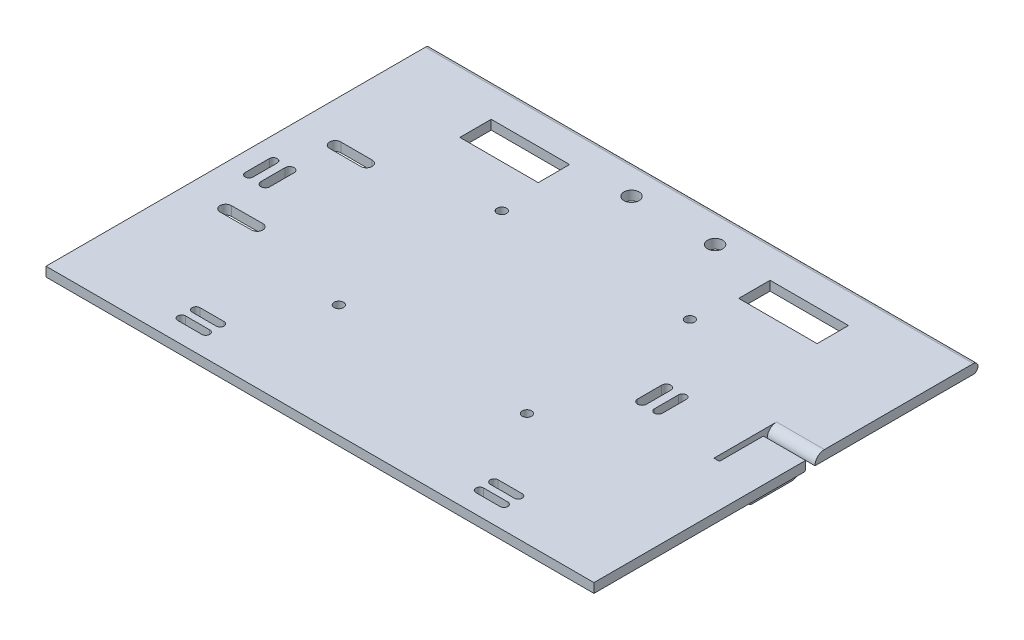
ISO-10303-21;
HEADER;
FILE_DESCRIPTION(('STEP AP214'),'2;1');
FILE_NAME('part.step','',(''),(''),'','','');
FILE_SCHEMA(('AUTOMOTIVE_DESIGN { 1 0 10303 214 1 1 1 1 }'));
ENDSEC;
DATA;
#1=APPLICATION_CONTEXT('core data for automotive mechanical design processes');
#2=APPLICATION_PROTOCOL_DEFINITION('international standard','automotive_design',2000,#1);
#3=PRODUCT_CONTEXT('',#1,'mechanical');
#4=PRODUCT('Part','Part','',(#3));
#5=PRODUCT_RELATED_PRODUCT_CATEGORY('part','',(#4));
#6=PRODUCT_DEFINITION_FORMATION('','',#4);
#7=PRODUCT_DEFINITION_CONTEXT('part definition',#1,'design');
#8=PRODUCT_DEFINITION('design','',#6,#7);
#9=PRODUCT_DEFINITION_SHAPE('','',#8);
#10=(LENGTH_UNIT() NAMED_UNIT(*) SI_UNIT(.MILLI.,.METRE.));
#11=(NAMED_UNIT(*) PLANE_ANGLE_UNIT() SI_UNIT($,.RADIAN.));
#12=(NAMED_UNIT(*) SI_UNIT($,.STERADIAN.) SOLID_ANGLE_UNIT());
#13=UNCERTAINTY_MEASURE_WITH_UNIT(LENGTH_MEASURE(1.E-05),#10,'distance_accuracy_value','');
#14=(GEOMETRIC_REPRESENTATION_CONTEXT(3) GLOBAL_UNCERTAINTY_ASSIGNED_CONTEXT((#13)) GLOBAL_UNIT_ASSIGNED_CONTEXT((#10,
#11,#12)) REPRESENTATION_CONTEXT('',''));
#15=CARTESIAN_POINT('',(0.,0.,0.));
#16=DIRECTION('',(0.,0.,1.));
#17=DIRECTION('',(1.,0.,0.));
#18=AXIS2_PLACEMENT_3D('',#15,#16,#17);
#19=CARTESIAN_POINT('',(0.,0.,0.));
#20=DIRECTION('',(0.,1.,0.));
#21=DIRECTION('',(0.,0.,1.));
#22=AXIS2_PLACEMENT_3D('',#19,#20,#21);
#23=PLANE('',#22);
#24=CARTESIAN_POINT('',(-80.2705507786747,0.,-3.37103274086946));
#25=DIRECTION('',(0.,-1.,0.));
#26=DIRECTION('',(0.,0.,-1.));
#27=AXIS2_PLACEMENT_3D('',#24,#25,#26);
#28=CIRCLE('',#27,1.25422735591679);
#29=CARTESIAN_POINT('',(-81.5247781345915,0.,-3.37103274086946));
#30=VERTEX_POINT('',#29);
#31=CARTESIAN_POINT('',(-79.0163234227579,0.,-3.37103274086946));
#32=VERTEX_POINT('',#31);
#33=EDGE_CURVE('E492',#30,#32,#28,.T.);
#34=ORIENTED_EDGE('',*,*,#33,.F.);
#35=DIRECTION('',(0.,0.,-1.));
#36=VECTOR('',#35,1.);
#37=CARTESIAN_POINT('',(-81.5247781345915,0.,4.33350673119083));
#38=LINE('',#37,#36);
#39=CARTESIAN_POINT('',(-81.5247781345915,0.,4.33350673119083));
#40=VERTEX_POINT('',#39);
#41=EDGE_CURVE('E482',#40,#30,#38,.T.);
#42=ORIENTED_EDGE('',*,*,#41,.F.);
#43=CARTESIAN_POINT('',(-80.2705507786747,0.,4.33350673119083));
#44=DIRECTION('',(0.,-1.,0.));
#45=DIRECTION('',(0.,0.,-1.));
#46=AXIS2_PLACEMENT_3D('',#43,#44,#45);
#47=CIRCLE('',#46,1.25422735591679);
#48=CARTESIAN_POINT('',(-79.0163234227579,0.,4.33350673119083));
#49=VERTEX_POINT('',#48);
#50=EDGE_CURVE('E496',#49,#40,#47,.T.);
#51=ORIENTED_EDGE('',*,*,#50,.F.);
#52=DIRECTION('',(0.,0.,1.));
#53=VECTOR('',#52,1.);
#54=CARTESIAN_POINT('',(-79.0163234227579,0.,4.33350673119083));
#55=LINE('',#54,#53);
#56=EDGE_CURVE('E56',#32,#49,#55,.T.);
#57=ORIENTED_EDGE('',*,*,#56,.F.);
#58=EDGE_LOOP('',(#34,#42,#51,#57));
#59=FACE_BOUND('',#58,.T.);
#60=CARTESIAN_POINT('',(43.6996249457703,0.,54.7245659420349));
#61=DIRECTION('',(0.,-1.,0.));
#62=DIRECTION('',(0.,0.,1.));
#63=AXIS2_PLACEMENT_3D('',#60,#61,#62);
#64=CIRCLE('',#63,1.25422735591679);
#65=CARTESIAN_POINT('',(43.6996249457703,0.,55.9787932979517));
#66=VERTEX_POINT('',#65);
#67=CARTESIAN_POINT('',(43.6996249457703,0.,53.4703385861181));
#68=VERTEX_POINT('',#67);
#69=EDGE_CURVE('E605',#66,#68,#64,.T.);
#70=ORIENTED_EDGE('',*,*,#69,.F.);
#71=DIRECTION('',(-1.,0.,0.));
#72=VECTOR('',#71,1.);
#73=CARTESIAN_POINT('',(51.4041644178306,0.,55.9787932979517));
#74=LINE('',#73,#72);
#75=CARTESIAN_POINT('',(51.4041644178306,0.,55.9787932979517));
#76=VERTEX_POINT('',#75);
#77=EDGE_CURVE('E609',#76,#66,#74,.T.);
#78=ORIENTED_EDGE('',*,*,#77,.F.);
#79=CARTESIAN_POINT('',(51.4041644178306,0.,54.7245659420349));
#80=DIRECTION('',(0.,-1.,0.));
#81=DIRECTION('',(0.,0.,1.));
#82=AXIS2_PLACEMENT_3D('',#79,#80,#81);
#83=CIRCLE('',#82,1.25422735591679);
#84=CARTESIAN_POINT('',(51.4041644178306,0.,53.4703385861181));
#85=VERTEX_POINT('',#84);
#86=EDGE_CURVE('E613',#85,#76,#83,.T.);
#87=ORIENTED_EDGE('',*,*,#86,.F.);
#88=DIRECTION('',(1.,0.,0.));
#89=VECTOR('',#88,1.);
#90=CARTESIAN_POINT('',(51.4041644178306,0.,53.4703385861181));
#91=LINE('',#90,#89);
#92=EDGE_CURVE('E64',#68,#85,#91,.T.);
#93=ORIENTED_EDGE('',*,*,#92,.F.);
#94=EDGE_LOOP('',(#70,#78,#87,#93));
#95=FACE_BOUND('',#94,.T.);
#96=CARTESIAN_POINT('',(43.6996249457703,0.,50.140098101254));
#97=DIRECTION('',(0.,-1.,0.));
#98=DIRECTION('',(0.,0.,1.));
#99=AXIS2_PLACEMENT_3D('',#96,#97,#98);
#100=CIRCLE('',#99,1.25422735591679);
#101=CARTESIAN_POINT('',(43.6996249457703,0.,51.3943254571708));
#102=VERTEX_POINT('',#101);
#103=CARTESIAN_POINT('',(43.6996249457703,0.,48.8858707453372));
#104=VERTEX_POINT('',#103);
#105=EDGE_CURVE('E562',#102,#104,#100,.T.);
#106=ORIENTED_EDGE('',*,*,#105,.F.);
#107=DIRECTION('',(-1.,0.,0.));
#108=VECTOR('',#107,1.);
#109=CARTESIAN_POINT('',(51.4041644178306,0.,51.3943254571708));
#110=LINE('',#109,#108);
#111=CARTESIAN_POINT('',(51.4041644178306,0.,51.3943254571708));
#112=VERTEX_POINT('',#111);
#113=EDGE_CURVE('E566',#112,#102,#110,.T.);
#114=ORIENTED_EDGE('',*,*,#113,.F.);
#115=CARTESIAN_POINT('',(51.4041644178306,0.,50.140098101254));
#116=DIRECTION('',(0.,-1.,0.));
#117=DIRECTION('',(0.,0.,1.));
#118=AXIS2_PLACEMENT_3D('',#115,#116,#117);
#119=CIRCLE('',#118,1.25422735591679);
#120=CARTESIAN_POINT('',(51.4041644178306,0.,48.8858707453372));
#121=VERTEX_POINT('',#120);
#122=EDGE_CURVE('E570',#121,#112,#119,.T.);
#123=ORIENTED_EDGE('',*,*,#122,.F.);
#124=DIRECTION('',(1.,0.,0.));
#125=VECTOR('',#124,1.);
#126=CARTESIAN_POINT('',(51.4041644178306,0.,48.8858707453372));
#127=LINE('',#126,#125);
#128=EDGE_CURVE('E558',#104,#121,#127,.T.);
#129=ORIENTED_EDGE('',*,*,#128,.F.);
#130=EDGE_LOOP('',(#106,#114,#123,#129));
#131=FACE_BOUND('',#130,.T.);
#132=CARTESIAN_POINT('',(-43.6996249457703,0.,50.140098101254));
#133=DIRECTION('',(0.,-1.,0.));
#134=DIRECTION('',(0.,0.,-1.));
#135=AXIS2_PLACEMENT_3D('',#132,#133,#134);
#136=CIRCLE('',#135,1.25422735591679);
#137=CARTESIAN_POINT('',(-43.6996249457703,0.,48.8858707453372));
#138=VERTEX_POINT('',#137);
#139=CARTESIAN_POINT('',(-43.6996249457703,0.,51.3943254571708));
#140=VERTEX_POINT('',#139);
#141=EDGE_CURVE('E516',#138,#140,#136,.T.);
#142=ORIENTED_EDGE('',*,*,#141,.F.);
#143=DIRECTION('',(1.,0.,0.));
#144=VECTOR('',#143,1.);
#145=CARTESIAN_POINT('',(-51.4041644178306,0.,48.8858707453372));
#146=LINE('',#145,#144);
#147=CARTESIAN_POINT('',(-51.4041644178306,0.,48.8858707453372));
#148=VERTEX_POINT('',#147);
#149=EDGE_CURVE('E520',#148,#138,#146,.T.);
#150=ORIENTED_EDGE('',*,*,#149,.F.);
#151=CARTESIAN_POINT('',(-51.4041644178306,0.,50.140098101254));
#152=DIRECTION('',(0.,-1.,0.));
#153=DIRECTION('',(0.,0.,-1.));
#154=AXIS2_PLACEMENT_3D('',#151,#152,#153);
#155=CIRCLE('',#154,1.25422735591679);
#156=CARTESIAN_POINT('',(-51.4041644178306,0.,51.3943254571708));
#157=VERTEX_POINT('',#156);
#158=EDGE_CURVE('E524',#157,#148,#155,.T.);
#159=ORIENTED_EDGE('',*,*,#158,.F.);
#160=DIRECTION('',(-1.,0.,0.));
#161=VECTOR('',#160,1.);
#162=CARTESIAN_POINT('',(-51.4041644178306,0.,51.3943254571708));
#163=LINE('',#162,#161);
#164=EDGE_CURVE('E512',#140,#157,#163,.T.);
#165=ORIENTED_EDGE('',*,*,#164,.F.);
#166=EDGE_LOOP('',(#142,#150,#159,#165));
#167=FACE_BOUND('',#166,.T.);
#168=CARTESIAN_POINT('',(50.2705507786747,0.,-3.37103274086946));
#169=DIRECTION('',(0.,-1.,0.));
#170=DIRECTION('',(0.,0.,1.));
#171=AXIS2_PLACEMENT_3D('',#168,#169,#170);
#172=CIRCLE('',#171,1.25422735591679);
#173=CARTESIAN_POINT('',(49.0163234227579,0.,-3.37103274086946));
#174=VERTEX_POINT('',#173);
#175=CARTESIAN_POINT('',(51.5247781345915,0.,-3.37103274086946));
#176=VERTEX_POINT('',#175);
#177=EDGE_CURVE('E780',#174,#176,#172,.T.);
#178=ORIENTED_EDGE('',*,*,#177,.F.);
#179=DIRECTION('',(0.,0.,-1.));
#180=VECTOR('',#179,1.);
#181=CARTESIAN_POINT('',(49.0163234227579,0.,4.33350673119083));
#182=LINE('',#181,#180);
#183=CARTESIAN_POINT('',(49.0163234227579,0.,4.33350673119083));
#184=VERTEX_POINT('',#183);
#185=EDGE_CURVE('E784',#184,#174,#182,.T.);
#186=ORIENTED_EDGE('',*,*,#185,.F.);
#187=CARTESIAN_POINT('',(50.2705507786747,0.,4.33350673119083));
#188=DIRECTION('',(0.,-1.,0.));
#189=DIRECTION('',(0.,0.,1.));
#190=AXIS2_PLACEMENT_3D('',#187,#188,#189);
#191=CIRCLE('',#190,1.25422735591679);
#192=CARTESIAN_POINT('',(51.5247781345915,0.,4.33350673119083));
#193=VERTEX_POINT('',#192);
#194=EDGE_CURVE('E557',#193,#184,#191,.T.);
#195=ORIENTED_EDGE('',*,*,#194,.F.);
#196=DIRECTION('',(0.,0.,1.));
#197=VECTOR('',#196,1.);
#198=CARTESIAN_POINT('',(51.5247781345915,0.,4.33350673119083));
#199=LINE('',#198,#197);
#200=EDGE_CURVE('E776',#176,#193,#199,.T.);
#201=ORIENTED_EDGE('',*,*,#200,.F.);
#202=EDGE_LOOP('',(#178,#186,#195,#201));
#203=FACE_BOUND('',#202,.T.);
#204=CARTESIAN_POINT('',(45.074466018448,0.,-3.37103274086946));
#205=DIRECTION('',(0.,-1.,0.));
#206=DIRECTION('',(0.,0.,1.));
#207=AXIS2_PLACEMENT_3D('',#204,#205,#206);
#208=CIRCLE('',#207,1.43340269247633);
#209=CARTESIAN_POINT('',(43.6410633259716,0.,-3.37103274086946));
#210=VERTEX_POINT('',#209);
#211=CARTESIAN_POINT('',(46.5078687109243,0.,-3.37103274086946));
#212=VERTEX_POINT('',#211);
#213=EDGE_CURVE('E736',#210,#212,#208,.T.);
#214=ORIENTED_EDGE('',*,*,#213,.F.);
#215=DIRECTION('',(0.,0.,-1.));
#216=VECTOR('',#215,1.);
#217=CARTESIAN_POINT('',(43.6410633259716,0.,4.33350673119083));
#218=LINE('',#217,#216);
#219=CARTESIAN_POINT('',(43.6410633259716,0.,4.33350673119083));
#220=VERTEX_POINT('',#219);
#221=EDGE_CURVE('E740',#220,#210,#218,.T.);
#222=ORIENTED_EDGE('',*,*,#221,.F.);
#223=CARTESIAN_POINT('',(45.074466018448,0.,4.33350673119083));
#224=DIRECTION('',(0.,-1.,0.));
#225=DIRECTION('',(0.,0.,1.));
#226=AXIS2_PLACEMENT_3D('',#223,#224,#225);
#227=CIRCLE('',#226,1.43340269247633);
#228=CARTESIAN_POINT('',(46.5078687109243,0.,4.33350673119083));
#229=VERTEX_POINT('',#228);
#230=EDGE_CURVE('E744',#229,#220,#227,.T.);
#231=ORIENTED_EDGE('',*,*,#230,.F.);
#232=DIRECTION('',(0.,0.,1.));
#233=VECTOR('',#232,1.);
#234=CARTESIAN_POINT('',(46.5078687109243,0.,4.33350673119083));
#235=LINE('',#234,#233);
#236=EDGE_CURVE('E732',#212,#229,#235,.T.);
#237=ORIENTED_EDGE('',*,*,#236,.F.);
#238=EDGE_LOOP('',(#214,#222,#231,#237));
#239=FACE_BOUND('',#238,.T.);
#240=CARTESIAN_POINT('',(-43.6996249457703,0.,54.7245659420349));
#241=DIRECTION('',(0.,-1.,0.));
#242=DIRECTION('',(0.,0.,-1.));
#243=AXIS2_PLACEMENT_3D('',#240,#241,#242);
#244=CIRCLE('',#243,1.25422735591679);
#245=CARTESIAN_POINT('',(-43.6996249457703,0.,53.4703385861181));
#246=VERTEX_POINT('',#245);
#247=CARTESIAN_POINT('',(-43.6996249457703,0.,55.9787932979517));
#248=VERTEX_POINT('',#247);
#249=EDGE_CURVE('E692',#246,#248,#244,.T.);
#250=ORIENTED_EDGE('',*,*,#249,.F.);
#251=DIRECTION('',(1.,0.,0.));
#252=VECTOR('',#251,1.);
#253=CARTESIAN_POINT('',(-51.4041644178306,0.,53.4703385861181));
#254=LINE('',#253,#252);
#255=CARTESIAN_POINT('',(-51.4041644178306,0.,53.4703385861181));
#256=VERTEX_POINT('',#255);
#257=EDGE_CURVE('E696',#256,#246,#254,.T.);
#258=ORIENTED_EDGE('',*,*,#257,.F.);
#259=CARTESIAN_POINT('',(-51.4041644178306,0.,54.7245659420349));
#260=DIRECTION('',(0.,-1.,0.));
#261=DIRECTION('',(0.,0.,-1.));
#262=AXIS2_PLACEMENT_3D('',#259,#260,#261);
#263=CIRCLE('',#262,1.25422735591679);
#264=CARTESIAN_POINT('',(-51.4041644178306,0.,55.9787932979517));
#265=VERTEX_POINT('',#264);
#266=EDGE_CURVE('E700',#265,#256,#263,.T.);
#267=ORIENTED_EDGE('',*,*,#266,.F.);
#268=DIRECTION('',(-1.,0.,0.));
#269=VECTOR('',#268,1.);
#270=CARTESIAN_POINT('',(-51.4041644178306,0.,55.9787932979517));
#271=LINE('',#270,#269);
#272=EDGE_CURVE('E688',#248,#265,#271,.T.);
#273=ORIENTED_EDGE('',*,*,#272,.F.);
#274=EDGE_LOOP('',(#250,#258,#267,#273));
#275=FACE_BOUND('',#274,.T.);
#276=CARTESIAN_POINT('',(-75.074466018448,0.,-3.37103274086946));
#277=DIRECTION('',(0.,-1.,0.));
#278=DIRECTION('',(0.,0.,-1.));
#279=AXIS2_PLACEMENT_3D('',#276,#277,#278);
#280=CIRCLE('',#279,1.43340269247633);
#281=CARTESIAN_POINT('',(-76.5078687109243,0.,-3.37103274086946));
#282=VERTEX_POINT('',#281);
#283=CARTESIAN_POINT('',(-73.6410633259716,0.,-3.37103274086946));
#284=VERTEX_POINT('',#283);
#285=EDGE_CURVE('E647',#282,#284,#280,.T.);
#286=ORIENTED_EDGE('',*,*,#285,.F.);
#287=DIRECTION('',(0.,0.,-1.));
#288=VECTOR('',#287,1.);
#289=CARTESIAN_POINT('',(-76.5078687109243,0.,4.33350673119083));
#290=LINE('',#289,#288);
#291=CARTESIAN_POINT('',(-76.5078687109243,0.,4.33350673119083));
#292=VERTEX_POINT('',#291);
#293=EDGE_CURVE('E651',#292,#282,#290,.T.);
#294=ORIENTED_EDGE('',*,*,#293,.F.);
#295=CARTESIAN_POINT('',(-75.074466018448,0.,4.33350673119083));
#296=DIRECTION('',(0.,-1.,0.));
#297=DIRECTION('',(0.,0.,-1.));
#298=AXIS2_PLACEMENT_3D('',#295,#296,#297);
#299=CIRCLE('',#298,1.43340269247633);
#300=CARTESIAN_POINT('',(-73.6410633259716,0.,4.33350673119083));
#301=VERTEX_POINT('',#300);
#302=EDGE_CURVE('E655',#301,#292,#299,.T.);
#303=ORIENTED_EDGE('',*,*,#302,.F.);
#304=DIRECTION('',(0.,0.,1.));
#305=VECTOR('',#304,1.);
#306=CARTESIAN_POINT('',(-73.6410633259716,0.,4.33350673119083));
#307=LINE('',#306,#305);
#308=EDGE_CURVE('E643',#284,#301,#307,.T.);
#309=ORIENTED_EDGE('',*,*,#308,.F.);
#310=EDGE_LOOP('',(#286,#294,#303,#309));
#311=FACE_BOUND('',#310,.T.);
#312=CARTESIAN_POINT('',(29.9999999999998,0.,-26.0000000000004));
#313=DIRECTION('',(0.,-1.,0.));
#314=DIRECTION('',(0.,0.,1.));
#315=AXIS2_PLACEMENT_3D('',#312,#313,#314);
#316=CIRCLE('',#315,1.50000000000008);
#317=CARTESIAN_POINT('',(29.9999999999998,0.,-24.5000000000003));
#318=VERTEX_POINT('',#317);
#319=EDGE_CURVE('E511',#318,#318,#316,.T.);
#320=ORIENTED_EDGE('',*,*,#319,.F.);
#321=EDGE_LOOP('',(#320));
#322=FACE_BOUND('',#321,.T.);
#323=CARTESIAN_POINT('',(-30.,0.,-26.));
#324=DIRECTION('',(0.,-1.,0.));
#325=DIRECTION('',(0.,0.,-1.));
#326=AXIS2_PLACEMENT_3D('',#323,#324,#325);
#327=CIRCLE('',#326,1.5);
#328=CARTESIAN_POINT('',(-30.,0.,-27.5));
#329=VERTEX_POINT('',#328);
#330=EDGE_CURVE('E828',#329,#329,#327,.T.);
#331=ORIENTED_EDGE('',*,*,#330,.F.);
#332=EDGE_LOOP('',(#331));
#333=FACE_BOUND('',#332,.T.);
#334=CARTESIAN_POINT('',(-30.,0.,26.));
#335=DIRECTION('',(0.,-1.,0.));
#336=DIRECTION('',(0.,0.,1.));
#337=AXIS2_PLACEMENT_3D('',#334,#335,#336);
#338=CIRCLE('',#337,1.5);
#339=CARTESIAN_POINT('',(-30.,0.,27.5));
#340=VERTEX_POINT('',#339);
#341=EDGE_CURVE('E818',#340,#340,#338,.T.);
#342=ORIENTED_EDGE('',*,*,#341,.F.);
#343=EDGE_LOOP('',(#342));
#344=FACE_BOUND('',#343,.T.);
#345=CARTESIAN_POINT('',(30.,0.,26.));
#346=DIRECTION('',(0.,-1.,0.));
#347=DIRECTION('',(0.,0.,-1.));
#348=AXIS2_PLACEMENT_3D('',#345,#346,#347);
#349=CIRCLE('',#348,1.5);
#350=CARTESIAN_POINT('',(30.,0.,24.5));
#351=VERTEX_POINT('',#350);
#352=EDGE_CURVE('E827',#351,#351,#349,.T.);
#353=ORIENTED_EDGE('',*,*,#352,.F.);
#354=EDGE_LOOP('',(#353));
#355=FACE_BOUND('',#354,.T.);
#356=CARTESIAN_POINT('',(-64.6065143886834,0.,17.4166743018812));
#357=DIRECTION('',(0.,-1.,0.));
#358=DIRECTION('',(0.,0.,1.));
#359=AXIS2_PLACEMENT_3D('',#356,#357,#358);
#360=CIRCLE('',#359,1.79175336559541);
#361=CARTESIAN_POINT('',(-64.6177436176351,0.,15.6249561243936));
#362=VERTEX_POINT('',#361);
#363=CARTESIAN_POINT('',(-64.5952851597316,0.,19.2083924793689));
#364=VERTEX_POINT('',#363);
#365=EDGE_CURVE('E943',#362,#364,#360,.T.);
#366=ORIENTED_EDGE('',*,*,#365,.F.);
#367=DIRECTION('',(0.999980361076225,0.,-0.00626717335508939));
#368=VECTOR('',#367,1.);
#369=CARTESIAN_POINT('',(-74.6175472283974,0.,15.6876278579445));
#370=LINE('',#369,#368);
#371=CARTESIAN_POINT('',(-74.6175472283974,0.,15.6876278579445));
#372=VERTEX_POINT('',#371);
#373=EDGE_CURVE('E947',#372,#362,#370,.T.);
#374=ORIENTED_EDGE('',*,*,#373,.F.);
#375=CARTESIAN_POINT('',(-74.6063179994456,0.,17.4793460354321));
#376=DIRECTION('',(0.,-1.,0.));
#377=DIRECTION('',(0.,0.,1.));
#378=AXIS2_PLACEMENT_3D('',#375,#376,#377);
#379=CIRCLE('',#378,1.79175336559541);
#380=CARTESIAN_POINT('',(-74.5950887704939,0.,19.2710642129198));
#381=VERTEX_POINT('',#380);
#382=EDGE_CURVE('E951',#381,#372,#379,.T.);
#383=ORIENTED_EDGE('',*,*,#382,.F.);
#384=DIRECTION('',(-0.999980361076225,0.,0.00626717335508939));
#385=VECTOR('',#384,1.);
#386=CARTESIAN_POINT('',(-74.5950887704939,0.,19.2710642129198));
#387=LINE('',#386,#385);
#388=EDGE_CURVE('E939',#364,#381,#387,.T.);
#389=ORIENTED_EDGE('',*,*,#388,.F.);
#390=EDGE_LOOP('',(#366,#374,#383,#389));
#391=FACE_BOUND('',#390,.T.);
#392=DIRECTION('',(0.,0.,-1.));
#393=VECTOR('',#392,1.);
#394=CARTESIAN_POINT('',(31.9777570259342,0.,-49.5977493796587));
#395=LINE('',#394,#393);
#396=CARTESIAN_POINT('',(31.9777570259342,0.,-39.5977493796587));
#397=VERTEX_POINT('',#396);
#398=CARTESIAN_POINT('',(31.9777570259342,0.,-49.5977493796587));
#399=VERTEX_POINT('',#398);
#400=EDGE_CURVE('E899',#397,#399,#395,.T.);
#401=ORIENTED_EDGE('',*,*,#400,.F.);
#402=DIRECTION('',(-1.,0.,0.));
#403=VECTOR('',#402,1.);
#404=CARTESIAN_POINT('',(56.9777570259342,0.,-39.5977493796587));
#405=LINE('',#404,#403);
#406=CARTESIAN_POINT('',(56.9777570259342,0.,-39.5977493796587));
#407=VERTEX_POINT('',#406);
#408=EDGE_CURVE('E903',#407,#397,#405,.T.);
#409=ORIENTED_EDGE('',*,*,#408,.F.);
#410=DIRECTION('',(0.,0.,1.));
#411=VECTOR('',#410,1.);
#412=CARTESIAN_POINT('',(56.9777570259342,0.,-49.5977493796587));
#413=LINE('',#412,#411);
#414=CARTESIAN_POINT('',(56.9777570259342,0.,-49.5977493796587));
#415=VERTEX_POINT('',#414);
#416=EDGE_CURVE('E907',#415,#407,#413,.T.);
#417=ORIENTED_EDGE('',*,*,#416,.F.);
#418=DIRECTION('',(1.,0.,0.));
#419=VECTOR('',#418,1.);
#420=CARTESIAN_POINT('',(56.9777570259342,0.,-49.5977493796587));
#421=LINE('',#420,#419);
#422=EDGE_CURVE('E895',#399,#415,#421,.T.);
#423=ORIENTED_EDGE('',*,*,#422,.F.);
#424=EDGE_LOOP('',(#401,#409,#417,#423));
#425=FACE_BOUND('',#424,.T.);
#426=CARTESIAN_POINT('',(-64.7161153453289,0.,-17.5591829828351));
#427=DIRECTION('',(0.,-1.,0.));
#428=DIRECTION('',(0.,0.,-1.));
#429=AXIS2_PLACEMENT_3D('',#426,#427,#428);
#430=CIRCLE('',#429,1.79175336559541);
#431=CARTESIAN_POINT('',(-64.7161153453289,0.,-19.3509363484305));
#432=VERTEX_POINT('',#431);
#433=CARTESIAN_POINT('',(-64.7161153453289,0.,-15.7674296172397));
#434=VERTEX_POINT('',#433);
#435=EDGE_CURVE('E853',#432,#434,#430,.T.);
#436=ORIENTED_EDGE('',*,*,#435,.F.);
#437=DIRECTION('',(1.,0.,0.));
#438=VECTOR('',#437,1.);
#439=CARTESIAN_POINT('',(-74.7161153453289,0.,-19.3509363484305));
#440=LINE('',#439,#438);
#441=CARTESIAN_POINT('',(-74.7161153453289,0.,-19.3509363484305));
#442=VERTEX_POINT('',#441);
#443=EDGE_CURVE('E857',#442,#432,#440,.T.);
#444=ORIENTED_EDGE('',*,*,#443,.F.);
#445=CARTESIAN_POINT('',(-74.7161153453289,0.,-17.5591829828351));
#446=DIRECTION('',(0.,-1.,0.));
#447=DIRECTION('',(0.,0.,-1.));
#448=AXIS2_PLACEMENT_3D('',#445,#446,#447);
#449=CIRCLE('',#448,1.79175336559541);
#450=CARTESIAN_POINT('',(-74.7161153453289,0.,-15.7674296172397));
#451=VERTEX_POINT('',#450);
#452=EDGE_CURVE('E861',#451,#442,#449,.T.);
#453=ORIENTED_EDGE('',*,*,#452,.F.);
#454=DIRECTION('',(-1.,0.,0.));
#455=VECTOR('',#454,1.);
#456=CARTESIAN_POINT('',(-74.7161153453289,0.,-15.7674296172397));
#457=LINE('',#456,#455);
#458=EDGE_CURVE('E849',#434,#451,#457,.T.);
#459=ORIENTED_EDGE('',*,*,#458,.F.);
#460=EDGE_LOOP('',(#436,#444,#453,#459));
#461=FACE_BOUND('',#460,.T.);
#462=DIRECTION('',(0.,0.,1.));
#463=VECTOR('',#462,1.);
#464=CARTESIAN_POINT('',(-31.9777570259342,0.,-49.5977493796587));
#465=LINE('',#464,#463);
#466=CARTESIAN_POINT('',(-31.9777570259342,0.,-49.5977493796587));
#467=VERTEX_POINT('',#466);
#468=CARTESIAN_POINT('',(-31.9777570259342,0.,-39.5977493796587));
#469=VERTEX_POINT('',#468);
#470=EDGE_CURVE('E986',#467,#469,#465,.T.);
#471=ORIENTED_EDGE('',*,*,#470,.F.);
#472=DIRECTION('',(1.,0.,0.));
#473=VECTOR('',#472,1.);
#474=CARTESIAN_POINT('',(-56.9777570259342,0.,-49.5977493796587));
#475=LINE('',#474,#473);
#476=CARTESIAN_POINT('',(-56.9777570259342,0.,-49.5977493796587));
#477=VERTEX_POINT('',#476);
#478=EDGE_CURVE('E990',#477,#467,#475,.T.);
#479=ORIENTED_EDGE('',*,*,#478,.F.);
#480=DIRECTION('',(0.,0.,-1.));
#481=VECTOR('',#480,1.);
#482=CARTESIAN_POINT('',(-56.9777570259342,0.,-49.5977493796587));
#483=LINE('',#482,#481);
#484=CARTESIAN_POINT('',(-56.9777570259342,0.,-39.5977493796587));
#485=VERTEX_POINT('',#484);
#486=EDGE_CURVE('E894',#485,#477,#483,.T.);
#487=ORIENTED_EDGE('',*,*,#486,.F.);
#488=DIRECTION('',(-1.,0.,0.));
#489=VECTOR('',#488,1.);
#490=CARTESIAN_POINT('',(-56.9777570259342,0.,-39.5977493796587));
#491=LINE('',#490,#489);
#492=EDGE_CURVE('E982',#469,#485,#491,.T.);
#493=ORIENTED_EDGE('',*,*,#492,.F.);
#494=EDGE_LOOP('',(#471,#479,#487,#493));
#495=FACE_BOUND('',#494,.T.);
#496=CARTESIAN_POINT('',(13.335,0.,-50.7089999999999));
#497=DIRECTION('',(0.,1.,0.));
#498=DIRECTION('',(0.,0.,1.));
#499=AXIS2_PLACEMENT_3D('',#496,#497,#498);
#500=CIRCLE('',#499,2.413);
#501=CARTESIAN_POINT('',(13.335,0.,-48.2959999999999));
#502=VERTEX_POINT('',#501);
#503=EDGE_CURVE('E1100',#502,#502,#500,.F.);
#504=ORIENTED_EDGE('',*,*,#503,.F.);
#505=EDGE_LOOP('',(#504));
#506=FACE_BOUND('',#505,.T.);
#507=CARTESIAN_POINT('',(-13.335,0.,-50.7089999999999));
#508=DIRECTION('',(0.,1.,0.));
#509=DIRECTION('',(0.,0.,1.));
#510=AXIS2_PLACEMENT_3D('',#507,#508,#509);
#511=CIRCLE('',#510,2.413);
#512=CARTESIAN_POINT('',(-13.335,0.,-48.2959999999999));
#513=VERTEX_POINT('',#512);
#514=EDGE_CURVE('E1099',#513,#513,#511,.F.);
#515=ORIENTED_EDGE('',*,*,#514,.F.);
#516=EDGE_LOOP('',(#515));
#517=FACE_BOUND('',#516,.T.);
#518=DIRECTION('',(0.,0.,1.));
#519=VECTOR('',#518,1.);
#520=CARTESIAN_POINT('',(-87.4,0.,-62.));
#521=LINE('',#520,#519);
#522=CARTESIAN_POINT('',(-87.4,0.,-59.));
#523=VERTEX_POINT('',#522);
#524=CARTESIAN_POINT('',(-87.4,0.,62.));
#525=VERTEX_POINT('',#524);
#526=EDGE_CURVE('E1127',#523,#525,#521,.T.);
#527=ORIENTED_EDGE('',*,*,#526,.F.);
#528=DIRECTION('',(-1.,0.,0.));
#529=VECTOR('',#528,1.);
#530=CARTESIAN_POINT('',(0.,0.,-59.));
#531=LINE('',#530,#529);
#532=CARTESIAN_POINT('',(87.4,0.,-59.));
#533=VERTEX_POINT('',#532);
#534=EDGE_CURVE('E11',#523,#533,#531,.F.);
#535=ORIENTED_EDGE('',*,*,#534,.T.);
#536=DIRECTION('',(0.,0.,-1.));
#537=VECTOR('',#536,1.);
#538=CARTESIAN_POINT('',(87.4,0.,-62.));
#539=LINE('',#538,#537);
#540=CARTESIAN_POINT('',(87.4,0.,-8.5));
#541=VERTEX_POINT('',#540);
#542=EDGE_CURVE('E1104',#541,#533,#539,.T.);
#543=ORIENTED_EDGE('',*,*,#542,.F.);
#544=DIRECTION('',(1.,0.,0.));
#545=VECTOR('',#544,1.);
#546=CARTESIAN_POINT('',(87.4,0.,-8.5));
#547=LINE('',#546,#545);
#548=CARTESIAN_POINT('',(72.16,0.,-8.5));
#549=VERTEX_POINT('',#548);
#550=EDGE_CURVE('E1063',#549,#541,#547,.T.);
#551=ORIENTED_EDGE('',*,*,#550,.F.);
#552=DIRECTION('',(0.,0.,-1.));
#553=VECTOR('',#552,1.);
#554=CARTESIAN_POINT('',(72.16,0.,8.5));
#555=LINE('',#554,#553);
#556=CARTESIAN_POINT('',(72.16,0.,7.5));
#557=VERTEX_POINT('',#556);
#558=EDGE_CURVE('E1059',#557,#549,#555,.T.);
#559=ORIENTED_EDGE('',*,*,#558,.F.);
#560=DIRECTION('',(1.,0.,0.));
#561=VECTOR('',#560,1.);
#562=CARTESIAN_POINT('',(69.938,0.,7.5));
#563=LINE('',#562,#561);
#564=CARTESIAN_POINT('',(69.938,0.,7.5));
#565=VERTEX_POINT('',#564);
#566=EDGE_CURVE('E1030',#565,#557,#563,.T.);
#567=ORIENTED_EDGE('',*,*,#566,.F.);
#568=DIRECTION('',(0.,0.,-1.));
#569=VECTOR('',#568,1.);
#570=CARTESIAN_POINT('',(69.938,0.,8.5));
#571=LINE('',#570,#569);
#572=CARTESIAN_POINT('',(69.938,0.,11.5));
#573=VERTEX_POINT('',#572);
#574=EDGE_CURVE('E1039',#573,#565,#571,.T.);
#575=ORIENTED_EDGE('',*,*,#574,.F.);
#576=DIRECTION('',(-1.,0.,0.));
#577=VECTOR('',#576,1.);
#578=CARTESIAN_POINT('',(73.938,0.,11.5));
#579=LINE('',#578,#577);
#580=CARTESIAN_POINT('',(85.9,0.,11.5));
#581=VERTEX_POINT('',#580);
#582=EDGE_CURVE('E1034',#581,#573,#579,.T.);
#583=ORIENTED_EDGE('',*,*,#582,.F.);
#584=DIRECTION('',(0.,0.,1.));
#585=VECTOR('',#584,1.);
#586=CARTESIAN_POINT('',(85.9,0.,11.5));
#587=LINE('',#586,#585);
#588=CARTESIAN_POINT('',(85.9,0.,-5.32842712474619));
#589=VERTEX_POINT('',#588);
#590=EDGE_CURVE('E1031',#589,#581,#587,.T.);
#591=ORIENTED_EDGE('',*,*,#590,.F.);
#592=DIRECTION('',(-1.,0.,0.));
#593=VECTOR('',#592,1.);
#594=CARTESIAN_POINT('',(85.9,0.,-5.32842712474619));
#595=LINE('',#594,#593);
#596=CARTESIAN_POINT('',(87.4,0.,-5.32842712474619));
#597=VERTEX_POINT('',#596);
#598=EDGE_CURVE('E1188',#589,#597,#595,.F.);
#599=ORIENTED_EDGE('',*,*,#598,.T.);
#600=CARTESIAN_POINT('',(87.4,0.,62.));
#601=VERTEX_POINT('',#600);
#602=EDGE_CURVE('E1123',#601,#597,#539,.T.);
#603=ORIENTED_EDGE('',*,*,#602,.F.);
#604=DIRECTION('',(1.,0.,0.));
#605=VECTOR('',#604,1.);
#606=CARTESIAN_POINT('',(-87.4,0.,62.));
#607=LINE('',#606,#605);
#608=EDGE_CURVE('E1130',#525,#601,#607,.T.);
#609=ORIENTED_EDGE('',*,*,#608,.F.);
#610=EDGE_LOOP('',(#527,#535,#543,#551,#559,#567,#575,#583,#591,#599,#603,#609));
#611=FACE_BOUND('',#610,.T.);
#612=ADVANCED_FACE('F39',(#59,#95,#131,#167,#203,#239,#275,#311,#322,#333,#344,#355,#391,#425,
#461,#495,#506,#517,#611),#23,.F.);
#613=CARTESIAN_POINT('',(87.4,3.,-62.));
#614=DIRECTION('',(-1.,0.,0.));
#615=DIRECTION('',(0.,0.,1.));
#616=AXIS2_PLACEMENT_3D('',#613,#614,#615);
#617=PLANE('',#616);
#618=ORIENTED_EDGE('',*,*,#602,.T.);
#619=CARTESIAN_POINT('',(87.4,1.,-2.5));
#620=DIRECTION('',(-1.,0.,0.));
#621=DIRECTION('',(0.,0.,1.));
#622=AXIS2_PLACEMENT_3D('',#619,#620,#621);
#623=CIRCLE('',#622,3.);
#624=CARTESIAN_POINT('',(87.4,0.999999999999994,-5.5));
#625=VERTEX_POINT('',#624);
#626=EDGE_CURVE('E1191',#597,#625,#623,.F.);
#627=ORIENTED_EDGE('',*,*,#626,.T.);
#628=DIRECTION('',(0.,1.,0.));
#629=VECTOR('',#628,1.);
#630=CARTESIAN_POINT('',(87.4,-22.8310665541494,-5.5));
#631=LINE('',#630,#629);
#632=CARTESIAN_POINT('',(87.4,3.,-5.5));
#633=VERTEX_POINT('',#632);
#634=EDGE_CURVE('E1064',#625,#633,#631,.T.);
#635=ORIENTED_EDGE('',*,*,#634,.T.);
#636=DIRECTION('',(0.,0.,-1.));
#637=VECTOR('',#636,1.);
#638=CARTESIAN_POINT('',(87.4,3.,-62.));
#639=LINE('',#638,#637);
#640=CARTESIAN_POINT('',(87.4,3.,62.));
#641=VERTEX_POINT('',#640);
#642=EDGE_CURVE('E1111',#641,#633,#639,.T.);
#643=ORIENTED_EDGE('',*,*,#642,.F.);
#644=DIRECTION('',(0.,-1.,0.));
#645=VECTOR('',#644,1.);
#646=CARTESIAN_POINT('',(87.4,3.,62.));
#647=LINE('',#646,#645);
#648=EDGE_CURVE('E1122',#641,#601,#647,.T.);
#649=ORIENTED_EDGE('',*,*,#648,.T.);
#650=EDGE_LOOP('',(#618,#627,#635,#643,#649));
#651=FACE_BOUND('',#650,.T.);
#652=ADVANCED_FACE('F1241',(#651),#617,.F.);
#653=CARTESIAN_POINT('',(87.4,1.5,-59.));
#654=DIRECTION('',(-1.,0.,0.));
#655=DIRECTION('',(0.,0.,1.));
#656=AXIS2_PLACEMENT_3D('',#653,#654,#655);
#657=CIRCLE('',#656,1.5);
#658=CARTESIAN_POINT('',(87.4,1.5,-60.5));
#659=VERTEX_POINT('',#658);
#660=EDGE_CURVE('E1291',#533,#659,#657,.F.);
#661=ORIENTED_EDGE('',*,*,#660,.T.);
#662=CARTESIAN_POINT('',(87.4,1.5,-59.));
#663=DIRECTION('',(-1.,0.,0.));
#664=DIRECTION('',(0.,0.,1.));
#665=AXIS2_PLACEMENT_3D('',#662,#663,#664);
#666=CIRCLE('',#665,1.5);
#667=CARTESIAN_POINT('',(87.4,3.,-59.));
#668=VERTEX_POINT('',#667);
#669=EDGE_CURVE('E49',#659,#668,#666,.F.);
#670=ORIENTED_EDGE('',*,*,#669,.T.);
#671=CARTESIAN_POINT('',(87.4,3.,-11.5));
#672=VERTEX_POINT('',#671);
#673=EDGE_CURVE('E1116',#672,#668,#639,.T.);
#674=ORIENTED_EDGE('',*,*,#673,.F.);
#675=CARTESIAN_POINT('',(87.4,0.,-11.5));
#676=DIRECTION('',(-1.,0.,0.));
#677=DIRECTION('',(0.,0.,1.));
#678=AXIS2_PLACEMENT_3D('',#675,#676,#677);
#679=CIRCLE('',#678,3.);
#680=EDGE_CURVE('E1285',#672,#541,#679,.F.);
#681=ORIENTED_EDGE('',*,*,#680,.T.);
#682=ORIENTED_EDGE('',*,*,#542,.T.);
#683=EDGE_LOOP('',(#661,#670,#674,#681,#682));
#684=FACE_BOUND('',#683,.T.);
#685=ADVANCED_FACE('F1225',(#684),#617,.F.);
#686=CARTESIAN_POINT('',(-87.4,3.,-62.));
#687=DIRECTION('',(1.,0.,0.));
#688=DIRECTION('',(0.,0.,-1.));
#689=AXIS2_PLACEMENT_3D('',#686,#687,#688);
#690=PLANE('',#689);
#691=DIRECTION('',(0.,0.,1.));
#692=VECTOR('',#691,1.);
#693=CARTESIAN_POINT('',(-87.4,3.,-62.));
#694=LINE('',#693,#692);
#695=CARTESIAN_POINT('',(-87.4,3.,-59.));
#696=VERTEX_POINT('',#695);
#697=CARTESIAN_POINT('',(-87.4,3.,62.));
#698=VERTEX_POINT('',#697);
#699=EDGE_CURVE('E1115',#696,#698,#694,.T.);
#700=ORIENTED_EDGE('',*,*,#699,.F.);
#701=CARTESIAN_POINT('',(-87.4,1.5,-59.));
#702=DIRECTION('',(1.,0.,0.));
#703=DIRECTION('',(0.,0.,-1.));
#704=AXIS2_PLACEMENT_3D('',#701,#702,#703);
#705=CIRCLE('',#704,1.5);
#706=CARTESIAN_POINT('',(-87.4,1.5,-60.5));
#707=VERTEX_POINT('',#706);
#708=EDGE_CURVE('E1264',#696,#707,#705,.F.);
#709=ORIENTED_EDGE('',*,*,#708,.T.);
#710=CARTESIAN_POINT('',(-87.4,1.5,-59.));
#711=DIRECTION('',(1.,0.,0.));
#712=DIRECTION('',(0.,0.,-1.));
#713=AXIS2_PLACEMENT_3D('',#710,#711,#712);
#714=CIRCLE('',#713,1.5);
#715=EDGE_CURVE('E1278',#707,#523,#714,.F.);
#716=ORIENTED_EDGE('',*,*,#715,.T.);
#717=ORIENTED_EDGE('',*,*,#526,.T.);
#718=DIRECTION('',(0.,-1.,0.));
#719=VECTOR('',#718,1.);
#720=CARTESIAN_POINT('',(-87.4,3.,62.));
#721=LINE('',#720,#719);
#722=EDGE_CURVE('E1136',#698,#525,#721,.T.);
#723=ORIENTED_EDGE('',*,*,#722,.F.);
#724=EDGE_LOOP('',(#700,#709,#716,#717,#723));
#725=FACE_BOUND('',#724,.T.);
#726=ADVANCED_FACE('F1254',(#725),#690,.F.);
#727=CARTESIAN_POINT('',(-87.4,3.,62.));
#728=DIRECTION('',(0.,0.,-1.));
#729=DIRECTION('',(-1.,0.,0.));
#730=AXIS2_PLACEMENT_3D('',#727,#728,#729);
#731=PLANE('',#730);
#732=ORIENTED_EDGE('',*,*,#608,.T.);
#733=ORIENTED_EDGE('',*,*,#648,.F.);
#734=DIRECTION('',(1.,0.,0.));
#735=VECTOR('',#734,1.);
#736=CARTESIAN_POINT('',(-87.4,3.,62.));
#737=LINE('',#736,#735);
#738=EDGE_CURVE('E1119',#698,#641,#737,.T.);
#739=ORIENTED_EDGE('',*,*,#738,.F.);
#740=ORIENTED_EDGE('',*,*,#722,.T.);
#741=EDGE_LOOP('',(#732,#733,#739,#740));
#742=FACE_BOUND('',#741,.T.);
#743=ADVANCED_FACE('F1252',(#742),#731,.F.);
#744=CARTESIAN_POINT('',(0.,3.,0.));
#745=DIRECTION('',(0.,1.,0.));
#746=DIRECTION('',(0.,0.,1.));
#747=AXIS2_PLACEMENT_3D('',#744,#745,#746);
#748=PLANE('',#747);
#749=DIRECTION('',(0.,0.,-1.));
#750=VECTOR('',#749,1.);
#751=CARTESIAN_POINT('',(-81.5247781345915,3.,4.33350673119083));
#752=LINE('',#751,#750);
#753=CARTESIAN_POINT('',(-81.5247781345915,3.,4.33350673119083));
#754=VERTEX_POINT('',#753);
#755=CARTESIAN_POINT('',(-81.5247781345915,3.,-3.37103274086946));
#756=VERTEX_POINT('',#755);
#757=EDGE_CURVE('E479',#754,#756,#752,.T.);
#758=ORIENTED_EDGE('',*,*,#757,.T.);
#759=CARTESIAN_POINT('',(-80.2705507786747,3.,-3.37103274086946));
#760=DIRECTION('',(0.,1.,0.));
#761=DIRECTION('',(0.,0.,1.));
#762=AXIS2_PLACEMENT_3D('',#759,#760,#761);
#763=CIRCLE('',#762,1.25422735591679);
#764=CARTESIAN_POINT('',(-79.0163234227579,3.,-3.37103274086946));
#765=VERTEX_POINT('',#764);
#766=EDGE_CURVE('E464',#756,#765,#763,.F.);
#767=ORIENTED_EDGE('',*,*,#766,.T.);
#768=DIRECTION('',(0.,0.,1.));
#769=VECTOR('',#768,1.);
#770=CARTESIAN_POINT('',(-79.0163234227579,3.,4.33350673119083));
#771=LINE('',#770,#769);
#772=CARTESIAN_POINT('',(-79.0163234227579,3.,4.33350673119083));
#773=VERTEX_POINT('',#772);
#774=EDGE_CURVE('E502',#765,#773,#771,.T.);
#775=ORIENTED_EDGE('',*,*,#774,.T.);
#776=CARTESIAN_POINT('',(-80.2705507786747,3.,4.33350673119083));
#777=DIRECTION('',(0.,1.,0.));
#778=DIRECTION('',(0.,0.,1.));
#779=AXIS2_PLACEMENT_3D('',#776,#777,#778);
#780=CIRCLE('',#779,1.25422735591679);
#781=EDGE_CURVE('E488',#773,#754,#780,.F.);
#782=ORIENTED_EDGE('',*,*,#781,.T.);
#783=EDGE_LOOP('',(#758,#767,#775,#782));
#784=FACE_BOUND('',#783,.T.);
#785=DIRECTION('',(-1.,0.,0.));
#786=VECTOR('',#785,1.);
#787=CARTESIAN_POINT('',(51.4041644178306,3.,55.9787932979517));
#788=LINE('',#787,#786);
#789=CARTESIAN_POINT('',(51.4041644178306,3.,55.9787932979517));
#790=VERTEX_POINT('',#789);
#791=CARTESIAN_POINT('',(43.6996249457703,3.,55.9787932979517));
#792=VERTEX_POINT('',#791);
#793=EDGE_CURVE('E604',#790,#792,#788,.T.);
#794=ORIENTED_EDGE('',*,*,#793,.T.);
#795=CARTESIAN_POINT('',(43.6996249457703,3.,54.7245659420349));
#796=DIRECTION('',(0.,1.,0.));
#797=DIRECTION('',(0.,0.,1.));
#798=AXIS2_PLACEMENT_3D('',#795,#796,#797);
#799=CIRCLE('',#798,1.25422735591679);
#800=CARTESIAN_POINT('',(43.6996249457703,3.,53.4703385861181));
#801=VERTEX_POINT('',#800);
#802=EDGE_CURVE('E631',#792,#801,#799,.F.);
#803=ORIENTED_EDGE('',*,*,#802,.T.);
#804=DIRECTION('',(1.,0.,0.));
#805=VECTOR('',#804,1.);
#806=CARTESIAN_POINT('',(51.4041644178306,3.,53.4703385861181));
#807=LINE('',#806,#805);
#808=CARTESIAN_POINT('',(51.4041644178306,3.,53.4703385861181));
#809=VERTEX_POINT('',#808);
#810=EDGE_CURVE('E626',#801,#809,#807,.T.);
#811=ORIENTED_EDGE('',*,*,#810,.T.);
#812=CARTESIAN_POINT('',(51.4041644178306,3.,54.7245659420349));
#813=DIRECTION('',(0.,1.,0.));
#814=DIRECTION('',(0.,0.,1.));
#815=AXIS2_PLACEMENT_3D('',#812,#813,#814);
#816=CIRCLE('',#815,1.25422735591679);
#817=EDGE_CURVE('E621',#809,#790,#816,.F.);
#818=ORIENTED_EDGE('',*,*,#817,.T.);
#819=EDGE_LOOP('',(#794,#803,#811,#818));
#820=FACE_BOUND('',#819,.T.);
#821=DIRECTION('',(-1.,0.,0.));
#822=VECTOR('',#821,1.);
#823=CARTESIAN_POINT('',(51.4041644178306,3.,51.3943254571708));
#824=LINE('',#823,#822);
#825=CARTESIAN_POINT('',(51.4041644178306,3.,51.3943254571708));
#826=VERTEX_POINT('',#825);
#827=CARTESIAN_POINT('',(43.6996249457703,3.,51.3943254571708));
#828=VERTEX_POINT('',#827);
#829=EDGE_CURVE('E561',#826,#828,#824,.T.);
#830=ORIENTED_EDGE('',*,*,#829,.T.);
#831=CARTESIAN_POINT('',(43.6996249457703,3.,50.140098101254));
#832=DIRECTION('',(0.,1.,0.));
#833=DIRECTION('',(0.,0.,1.));
#834=AXIS2_PLACEMENT_3D('',#831,#832,#833);
#835=CIRCLE('',#834,1.25422735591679);
#836=CARTESIAN_POINT('',(43.6996249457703,3.,48.8858707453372));
#837=VERTEX_POINT('',#836);
#838=EDGE_CURVE('E589',#828,#837,#835,.F.);
#839=ORIENTED_EDGE('',*,*,#838,.T.);
#840=DIRECTION('',(1.,0.,0.));
#841=VECTOR('',#840,1.);
#842=CARTESIAN_POINT('',(51.4041644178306,3.,48.8858707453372));
#843=LINE('',#842,#841);
#844=CARTESIAN_POINT('',(51.4041644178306,3.,48.8858707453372));
#845=VERTEX_POINT('',#844);
#846=EDGE_CURVE('E584',#837,#845,#843,.T.);
#847=ORIENTED_EDGE('',*,*,#846,.T.);
#848=CARTESIAN_POINT('',(51.4041644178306,3.,50.140098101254));
#849=DIRECTION('',(0.,1.,0.));
#850=DIRECTION('',(0.,0.,1.));
#851=AXIS2_PLACEMENT_3D('',#848,#849,#850);
#852=CIRCLE('',#851,1.25422735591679);
#853=EDGE_CURVE('E579',#845,#826,#852,.F.);
#854=ORIENTED_EDGE('',*,*,#853,.T.);
#855=EDGE_LOOP('',(#830,#839,#847,#854));
#856=FACE_BOUND('',#855,.T.);
#857=DIRECTION('',(1.,0.,0.));
#858=VECTOR('',#857,1.);
#859=CARTESIAN_POINT('',(-51.4041644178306,3.,48.8858707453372));
#860=LINE('',#859,#858);
#861=CARTESIAN_POINT('',(-51.4041644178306,3.,48.8858707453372));
#862=VERTEX_POINT('',#861);
#863=CARTESIAN_POINT('',(-43.6996249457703,3.,48.8858707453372));
#864=VERTEX_POINT('',#863);
#865=EDGE_CURVE('E515',#862,#864,#860,.T.);
#866=ORIENTED_EDGE('',*,*,#865,.T.);
#867=CARTESIAN_POINT('',(-43.6996249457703,3.,50.140098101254));
#868=DIRECTION('',(0.,1.,0.));
#869=DIRECTION('',(0.,0.,1.));
#870=AXIS2_PLACEMENT_3D('',#867,#868,#869);
#871=CIRCLE('',#870,1.25422735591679);
#872=CARTESIAN_POINT('',(-43.6996249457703,3.,51.3943254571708));
#873=VERTEX_POINT('',#872);
#874=EDGE_CURVE('E544',#864,#873,#871,.F.);
#875=ORIENTED_EDGE('',*,*,#874,.T.);
#876=DIRECTION('',(-1.,0.,0.));
#877=VECTOR('',#876,1.);
#878=CARTESIAN_POINT('',(-51.4041644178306,3.,51.3943254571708));
#879=LINE('',#878,#877);
#880=CARTESIAN_POINT('',(-51.4041644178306,3.,51.3943254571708));
#881=VERTEX_POINT('',#880);
#882=EDGE_CURVE('E539',#873,#881,#879,.T.);
#883=ORIENTED_EDGE('',*,*,#882,.T.);
#884=CARTESIAN_POINT('',(-51.4041644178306,3.,50.140098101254));
#885=DIRECTION('',(0.,1.,0.));
#886=DIRECTION('',(0.,0.,1.));
#887=AXIS2_PLACEMENT_3D('',#884,#885,#886);
#888=CIRCLE('',#887,1.25422735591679);
#889=EDGE_CURVE('E533',#881,#862,#888,.F.);
#890=ORIENTED_EDGE('',*,*,#889,.T.);
#891=EDGE_LOOP('',(#866,#875,#883,#890));
#892=FACE_BOUND('',#891,.T.);
#893=DIRECTION('',(0.,0.,-1.));
#894=VECTOR('',#893,1.);
#895=CARTESIAN_POINT('',(49.0163234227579,3.,4.33350673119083));
#896=LINE('',#895,#894);
#897=CARTESIAN_POINT('',(49.0163234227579,3.,4.33350673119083));
#898=VERTEX_POINT('',#897);
#899=CARTESIAN_POINT('',(49.0163234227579,3.,-3.37103274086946));
#900=VERTEX_POINT('',#899);
#901=EDGE_CURVE('E779',#898,#900,#896,.T.);
#902=ORIENTED_EDGE('',*,*,#901,.T.);
#903=CARTESIAN_POINT('',(50.2705507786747,3.,-3.37103274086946));
#904=DIRECTION('',(0.,1.,0.));
#905=DIRECTION('',(0.,0.,1.));
#906=AXIS2_PLACEMENT_3D('',#903,#904,#905);
#907=CIRCLE('',#906,1.25422735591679);
#908=CARTESIAN_POINT('',(51.5247781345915,3.,-3.37103274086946));
#909=VERTEX_POINT('',#908);
#910=EDGE_CURVE('E805',#900,#909,#907,.F.);
#911=ORIENTED_EDGE('',*,*,#910,.T.);
#912=DIRECTION('',(0.,0.,1.));
#913=VECTOR('',#912,1.);
#914=CARTESIAN_POINT('',(51.5247781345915,3.,4.33350673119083));
#915=LINE('',#914,#913);
#916=CARTESIAN_POINT('',(51.5247781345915,3.,4.33350673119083));
#917=VERTEX_POINT('',#916);
#918=EDGE_CURVE('E800',#909,#917,#915,.T.);
#919=ORIENTED_EDGE('',*,*,#918,.T.);
#920=CARTESIAN_POINT('',(50.2705507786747,3.,4.33350673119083));
#921=DIRECTION('',(0.,1.,0.));
#922=DIRECTION('',(0.,0.,1.));
#923=AXIS2_PLACEMENT_3D('',#920,#921,#922);
#924=CIRCLE('',#923,1.25422735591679);
#925=EDGE_CURVE('E795',#917,#898,#924,.F.);
#926=ORIENTED_EDGE('',*,*,#925,.T.);
#927=EDGE_LOOP('',(#902,#911,#919,#926));
#928=FACE_BOUND('',#927,.T.);
#929=DIRECTION('',(0.,0.,-1.));
#930=VECTOR('',#929,1.);
#931=CARTESIAN_POINT('',(43.6410633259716,3.,4.33350673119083));
#932=LINE('',#931,#930);
#933=CARTESIAN_POINT('',(43.6410633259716,3.,4.33350673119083));
#934=VERTEX_POINT('',#933);
#935=CARTESIAN_POINT('',(43.6410633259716,3.,-3.37103274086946));
#936=VERTEX_POINT('',#935);
#937=EDGE_CURVE('E735',#934,#936,#932,.T.);
#938=ORIENTED_EDGE('',*,*,#937,.T.);
#939=CARTESIAN_POINT('',(45.074466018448,3.,-3.37103274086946));
#940=DIRECTION('',(0.,1.,0.));
#941=DIRECTION('',(0.,0.,1.));
#942=AXIS2_PLACEMENT_3D('',#939,#940,#941);
#943=CIRCLE('',#942,1.43340269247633);
#944=CARTESIAN_POINT('',(46.5078687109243,3.,-3.37103274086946));
#945=VERTEX_POINT('',#944);
#946=EDGE_CURVE('E763',#936,#945,#943,.F.);
#947=ORIENTED_EDGE('',*,*,#946,.T.);
#948=DIRECTION('',(0.,0.,1.));
#949=VECTOR('',#948,1.);
#950=CARTESIAN_POINT('',(46.5078687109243,3.,4.33350673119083));
#951=LINE('',#950,#949);
#952=CARTESIAN_POINT('',(46.5078687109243,3.,4.33350673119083));
#953=VERTEX_POINT('',#952);
#954=EDGE_CURVE('E758',#945,#953,#951,.T.);
#955=ORIENTED_EDGE('',*,*,#954,.T.);
#956=CARTESIAN_POINT('',(45.074466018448,3.,4.33350673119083));
#957=DIRECTION('',(0.,1.,0.));
#958=DIRECTION('',(0.,0.,1.));
#959=AXIS2_PLACEMENT_3D('',#956,#957,#958);
#960=CIRCLE('',#959,1.43340269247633);
#961=EDGE_CURVE('E753',#953,#934,#960,.F.);
#962=ORIENTED_EDGE('',*,*,#961,.T.);
#963=EDGE_LOOP('',(#938,#947,#955,#962));
#964=FACE_BOUND('',#963,.T.);
#965=DIRECTION('',(1.,0.,0.));
#966=VECTOR('',#965,1.);
#967=CARTESIAN_POINT('',(-51.4041644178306,3.,53.4703385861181));
#968=LINE('',#967,#966);
#969=CARTESIAN_POINT('',(-51.4041644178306,3.,53.4703385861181));
#970=VERTEX_POINT('',#969);
#971=CARTESIAN_POINT('',(-43.6996249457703,3.,53.4703385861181));
#972=VERTEX_POINT('',#971);
#973=EDGE_CURVE('E691',#970,#972,#968,.T.);
#974=ORIENTED_EDGE('',*,*,#973,.T.);
#975=CARTESIAN_POINT('',(-43.6996249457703,3.,54.7245659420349));
#976=DIRECTION('',(0.,1.,0.));
#977=DIRECTION('',(0.,0.,1.));
#978=AXIS2_PLACEMENT_3D('',#975,#976,#977);
#979=CIRCLE('',#978,1.25422735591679);
#980=CARTESIAN_POINT('',(-43.6996249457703,3.,55.9787932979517));
#981=VERTEX_POINT('',#980);
#982=EDGE_CURVE('E719',#972,#981,#979,.F.);
#983=ORIENTED_EDGE('',*,*,#982,.T.);
#984=DIRECTION('',(-1.,0.,0.));
#985=VECTOR('',#984,1.);
#986=CARTESIAN_POINT('',(-51.4041644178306,3.,55.9787932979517));
#987=LINE('',#986,#985);
#988=CARTESIAN_POINT('',(-51.4041644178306,3.,55.9787932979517));
#989=VERTEX_POINT('',#988);
#990=EDGE_CURVE('E714',#981,#989,#987,.T.);
#991=ORIENTED_EDGE('',*,*,#990,.T.);
#992=CARTESIAN_POINT('',(-51.4041644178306,3.,54.7245659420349));
#993=DIRECTION('',(0.,1.,0.));
#994=DIRECTION('',(0.,0.,1.));
#995=AXIS2_PLACEMENT_3D('',#992,#993,#994);
#996=CIRCLE('',#995,1.25422735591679);
#997=EDGE_CURVE('E709',#989,#970,#996,.F.);
#998=ORIENTED_EDGE('',*,*,#997,.T.);
#999=EDGE_LOOP('',(#974,#983,#991,#998));
#1000=FACE_BOUND('',#999,.T.);
#1001=DIRECTION('',(0.,0.,-1.));
#1002=VECTOR('',#1001,1.);
#1003=CARTESIAN_POINT('',(-76.5078687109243,3.,4.33350673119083));
#1004=LINE('',#1003,#1002);
#1005=CARTESIAN_POINT('',(-76.5078687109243,3.,4.33350673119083));
#1006=VERTEX_POINT('',#1005);
#1007=CARTESIAN_POINT('',(-76.5078687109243,3.,-3.37103274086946));
#1008=VERTEX_POINT('',#1007);
#1009=EDGE_CURVE('E646',#1006,#1008,#1004,.T.);
#1010=ORIENTED_EDGE('',*,*,#1009,.T.);
#1011=CARTESIAN_POINT('',(-75.074466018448,3.,-3.37103274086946));
#1012=DIRECTION('',(0.,1.,0.));
#1013=DIRECTION('',(0.,0.,1.));
#1014=AXIS2_PLACEMENT_3D('',#1011,#1012,#1013);
#1015=CIRCLE('',#1014,1.43340269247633);
#1016=CARTESIAN_POINT('',(-73.6410633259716,3.,-3.37103274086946));
#1017=VERTEX_POINT('',#1016);
#1018=EDGE_CURVE('E675',#1008,#1017,#1015,.F.);
#1019=ORIENTED_EDGE('',*,*,#1018,.T.);
#1020=DIRECTION('',(0.,0.,1.));
#1021=VECTOR('',#1020,1.);
#1022=CARTESIAN_POINT('',(-73.6410633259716,3.,4.33350673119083));
#1023=LINE('',#1022,#1021);
#1024=CARTESIAN_POINT('',(-73.6410633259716,3.,4.33350673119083));
#1025=VERTEX_POINT('',#1024);
#1026=EDGE_CURVE('E670',#1017,#1025,#1023,.T.);
#1027=ORIENTED_EDGE('',*,*,#1026,.T.);
#1028=CARTESIAN_POINT('',(-75.074466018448,3.,4.33350673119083));
#1029=DIRECTION('',(0.,1.,0.));
#1030=DIRECTION('',(0.,0.,1.));
#1031=AXIS2_PLACEMENT_3D('',#1028,#1029,#1030);
#1032=CIRCLE('',#1031,1.43340269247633);
#1033=EDGE_CURVE('E664',#1025,#1006,#1032,.F.);
#1034=ORIENTED_EDGE('',*,*,#1033,.T.);
#1035=EDGE_LOOP('',(#1010,#1019,#1027,#1034));
#1036=FACE_BOUND('',#1035,.T.);
#1037=CARTESIAN_POINT('',(29.9999999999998,3.,-26.0000000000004));
#1038=DIRECTION('',(0.,1.,0.));
#1039=DIRECTION('',(0.,0.,1.));
#1040=AXIS2_PLACEMENT_3D('',#1037,#1038,#1039);
#1041=CIRCLE('',#1040,1.50000000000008);
#1042=CARTESIAN_POINT('',(29.9999999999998,3.,-24.5000000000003));
#1043=VERTEX_POINT('',#1042);
#1044=EDGE_CURVE('E832',#1043,#1043,#1041,.F.);
#1045=ORIENTED_EDGE('',*,*,#1044,.T.);
#1046=EDGE_LOOP('',(#1045));
#1047=FACE_BOUND('',#1046,.T.);
#1048=CARTESIAN_POINT('',(-30.,3.,-26.));
#1049=DIRECTION('',(0.,1.,0.));
#1050=DIRECTION('',(0.,0.,1.));
#1051=AXIS2_PLACEMENT_3D('',#1048,#1049,#1050);
#1052=CIRCLE('',#1051,1.5);
#1053=CARTESIAN_POINT('',(-30.,3.,-24.5));
#1054=VERTEX_POINT('',#1053);
#1055=EDGE_CURVE('E823',#1054,#1054,#1052,.F.);
#1056=ORIENTED_EDGE('',*,*,#1055,.T.);
#1057=EDGE_LOOP('',(#1056));
#1058=FACE_BOUND('',#1057,.T.);
#1059=CARTESIAN_POINT('',(-30.,3.,26.));
#1060=DIRECTION('',(0.,1.,0.));
#1061=DIRECTION('',(0.,0.,1.));
#1062=AXIS2_PLACEMENT_3D('',#1059,#1060,#1061);
#1063=CIRCLE('',#1062,1.5);
#1064=CARTESIAN_POINT('',(-30.,3.,27.5));
#1065=VERTEX_POINT('',#1064);
#1066=EDGE_CURVE('E822',#1065,#1065,#1063,.F.);
#1067=ORIENTED_EDGE('',*,*,#1066,.T.);
#1068=EDGE_LOOP('',(#1067));
#1069=FACE_BOUND('',#1068,.T.);
#1070=CARTESIAN_POINT('',(30.,3.,26.));
#1071=DIRECTION('',(0.,1.,0.));
#1072=DIRECTION('',(0.,0.,1.));
#1073=AXIS2_PLACEMENT_3D('',#1070,#1071,#1072);
#1074=CIRCLE('',#1073,1.5);
#1075=CARTESIAN_POINT('',(30.,3.,27.5));
#1076=VERTEX_POINT('',#1075);
#1077=EDGE_CURVE('E845',#1076,#1076,#1074,.F.);
#1078=ORIENTED_EDGE('',*,*,#1077,.T.);
#1079=EDGE_LOOP('',(#1078));
#1080=FACE_BOUND('',#1079,.T.);
#1081=ORIENTED_EDGE('',*,*,#673,.T.);
#1082=DIRECTION('',(-1.,0.,0.));
#1083=VECTOR('',#1082,1.);
#1084=CARTESIAN_POINT('',(-87.4,3.,-59.));
#1085=LINE('',#1084,#1083);
#1086=EDGE_CURVE('E1273',#668,#696,#1085,.T.);
#1087=ORIENTED_EDGE('',*,*,#1086,.T.);
#1088=ORIENTED_EDGE('',*,*,#699,.T.);
#1089=ORIENTED_EDGE('',*,*,#738,.T.);
#1090=ORIENTED_EDGE('',*,*,#642,.T.);
#1091=DIRECTION('',(1.,0.,0.));
#1092=VECTOR('',#1091,1.);
#1093=CARTESIAN_POINT('',(73.938,3.,-5.5));
#1094=LINE('',#1093,#1092);
#1095=CARTESIAN_POINT('',(73.938,3.,-5.5));
#1096=VERTEX_POINT('',#1095);
#1097=EDGE_CURVE('E1076',#1096,#633,#1094,.T.);
#1098=ORIENTED_EDGE('',*,*,#1097,.F.);
#1099=DIRECTION('',(0.,0.,-1.));
#1100=VECTOR('',#1099,1.);
#1101=CARTESIAN_POINT('',(73.938,3.,-5.5));
#1102=LINE('',#1101,#1100);
#1103=CARTESIAN_POINT('',(73.938,3.,8.5));
#1104=VERTEX_POINT('',#1103);
#1105=EDGE_CURVE('E1072',#1104,#1096,#1102,.T.);
#1106=ORIENTED_EDGE('',*,*,#1105,.F.);
#1107=DIRECTION('',(1.,0.,0.));
#1108=VECTOR('',#1107,1.);
#1109=CARTESIAN_POINT('',(73.938,3.,8.5));
#1110=LINE('',#1109,#1108);
#1111=CARTESIAN_POINT('',(72.16,3.,8.5));
#1112=VERTEX_POINT('',#1111);
#1113=EDGE_CURVE('E1068',#1112,#1104,#1110,.T.);
#1114=ORIENTED_EDGE('',*,*,#1113,.F.);
#1115=DIRECTION('',(0.,0.,1.));
#1116=VECTOR('',#1115,1.);
#1117=CARTESIAN_POINT('',(72.16,3.,8.5));
#1118=LINE('',#1117,#1116);
#1119=CARTESIAN_POINT('',(72.16,3.,-11.5));
#1120=VERTEX_POINT('',#1119);
#1121=EDGE_CURVE('E1058',#1120,#1112,#1118,.T.);
#1122=ORIENTED_EDGE('',*,*,#1121,.F.);
#1123=DIRECTION('',(-1.,0.,0.));
#1124=VECTOR('',#1123,1.);
#1125=CARTESIAN_POINT('',(87.4,3.,-11.5));
#1126=LINE('',#1125,#1124);
#1127=EDGE_CURVE('E1211',#1120,#672,#1126,.F.);
#1128=ORIENTED_EDGE('',*,*,#1127,.T.);
#1129=EDGE_LOOP('',(#1081,#1087,#1088,#1089,#1090,#1098,#1106,#1114,#1122,#1128));
#1130=FACE_BOUND('',#1129,.T.);
#1131=DIRECTION('',(0.999980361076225,0.,-0.00626717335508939));
#1132=VECTOR('',#1131,1.);
#1133=CARTESIAN_POINT('',(-74.6175472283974,3.,15.6876278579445));
#1134=LINE('',#1133,#1132);
#1135=CARTESIAN_POINT('',(-74.6175472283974,3.,15.6876278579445));
#1136=VERTEX_POINT('',#1135);
#1137=CARTESIAN_POINT('',(-64.6177436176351,3.,15.6249561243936));
#1138=VERTEX_POINT('',#1137);
#1139=EDGE_CURVE('E942',#1136,#1138,#1134,.T.);
#1140=ORIENTED_EDGE('',*,*,#1139,.T.);
#1141=CARTESIAN_POINT('',(-64.6065143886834,3.,17.4166743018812));
#1142=DIRECTION('',(0.,1.,0.));
#1143=DIRECTION('',(0.,0.,1.));
#1144=AXIS2_PLACEMENT_3D('',#1141,#1142,#1143);
#1145=CIRCLE('',#1144,1.79175336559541);
#1146=CARTESIAN_POINT('',(-64.5952851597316,3.,19.2083924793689));
#1147=VERTEX_POINT('',#1146);
#1148=EDGE_CURVE('E969',#1138,#1147,#1145,.F.);
#1149=ORIENTED_EDGE('',*,*,#1148,.T.);
#1150=DIRECTION('',(-0.999980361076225,0.,0.00626717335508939));
#1151=VECTOR('',#1150,1.);
#1152=CARTESIAN_POINT('',(-74.5950887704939,3.,19.2710642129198));
#1153=LINE('',#1152,#1151);
#1154=CARTESIAN_POINT('',(-74.5950887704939,3.,19.2710642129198));
#1155=VERTEX_POINT('',#1154);
#1156=EDGE_CURVE('E964',#1147,#1155,#1153,.T.);
#1157=ORIENTED_EDGE('',*,*,#1156,.T.);
#1158=CARTESIAN_POINT('',(-74.6063179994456,3.,17.4793460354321));
#1159=DIRECTION('',(0.,1.,0.));
#1160=DIRECTION('',(0.,0.,1.));
#1161=AXIS2_PLACEMENT_3D('',#1158,#1159,#1160);
#1162=CIRCLE('',#1161,1.79175336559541);
#1163=EDGE_CURVE('E959',#1155,#1136,#1162,.F.);
#1164=ORIENTED_EDGE('',*,*,#1163,.T.);
#1165=EDGE_LOOP('',(#1140,#1149,#1157,#1164));
#1166=FACE_BOUND('',#1165,.T.);
#1167=DIRECTION('',(-1.,0.,0.));
#1168=VECTOR('',#1167,1.);
#1169=CARTESIAN_POINT('',(56.9777570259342,3.,-39.5977493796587));
#1170=LINE('',#1169,#1168);
#1171=CARTESIAN_POINT('',(56.9777570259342,3.,-39.5977493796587));
#1172=VERTEX_POINT('',#1171);
#1173=CARTESIAN_POINT('',(31.9777570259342,3.,-39.5977493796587));
#1174=VERTEX_POINT('',#1173);
#1175=EDGE_CURVE('E898',#1172,#1174,#1170,.T.);
#1176=ORIENTED_EDGE('',*,*,#1175,.T.);
#1177=DIRECTION('',(0.,0.,-1.));
#1178=VECTOR('',#1177,1.);
#1179=CARTESIAN_POINT('',(31.9777570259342,3.,-49.5977493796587));
#1180=LINE('',#1179,#1178);
#1181=CARTESIAN_POINT('',(31.9777570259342,3.,-49.5977493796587));
#1182=VERTEX_POINT('',#1181);
#1183=EDGE_CURVE('E926',#1174,#1182,#1180,.T.);
#1184=ORIENTED_EDGE('',*,*,#1183,.T.);
#1185=DIRECTION('',(1.,0.,0.));
#1186=VECTOR('',#1185,1.);
#1187=CARTESIAN_POINT('',(56.9777570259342,3.,-49.5977493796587));
#1188=LINE('',#1187,#1186);
#1189=CARTESIAN_POINT('',(56.9777570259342,3.,-49.5977493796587));
#1190=VERTEX_POINT('',#1189);
#1191=EDGE_CURVE('E921',#1182,#1190,#1188,.T.);
#1192=ORIENTED_EDGE('',*,*,#1191,.T.);
#1193=DIRECTION('',(0.,0.,1.));
#1194=VECTOR('',#1193,1.);
#1195=CARTESIAN_POINT('',(56.9777570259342,3.,-49.5977493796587));
#1196=LINE('',#1195,#1194);
#1197=EDGE_CURVE('E916',#1190,#1172,#1196,.T.);
#1198=ORIENTED_EDGE('',*,*,#1197,.T.);
#1199=EDGE_LOOP('',(#1176,#1184,#1192,#1198));
#1200=FACE_BOUND('',#1199,.T.);
#1201=DIRECTION('',(1.,0.,0.));
#1202=VECTOR('',#1201,1.);
#1203=CARTESIAN_POINT('',(-74.7161153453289,3.,-19.3509363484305));
#1204=LINE('',#1203,#1202);
#1205=CARTESIAN_POINT('',(-74.7161153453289,3.,-19.3509363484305));
#1206=VERTEX_POINT('',#1205);
#1207=CARTESIAN_POINT('',(-64.7161153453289,3.,-19.3509363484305));
#1208=VERTEX_POINT('',#1207);
#1209=EDGE_CURVE('E852',#1206,#1208,#1204,.T.);
#1210=ORIENTED_EDGE('',*,*,#1209,.T.);
#1211=CARTESIAN_POINT('',(-64.7161153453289,3.,-17.5591829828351));
#1212=DIRECTION('',(0.,1.,0.));
#1213=DIRECTION('',(0.,0.,1.));
#1214=AXIS2_PLACEMENT_3D('',#1211,#1212,#1213);
#1215=CIRCLE('',#1214,1.79175336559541);
#1216=CARTESIAN_POINT('',(-64.7161153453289,3.,-15.7674296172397));
#1217=VERTEX_POINT('',#1216);
#1218=EDGE_CURVE('E881',#1208,#1217,#1215,.F.);
#1219=ORIENTED_EDGE('',*,*,#1218,.T.);
#1220=DIRECTION('',(-1.,0.,0.));
#1221=VECTOR('',#1220,1.);
#1222=CARTESIAN_POINT('',(-74.7161153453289,3.,-15.7674296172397));
#1223=LINE('',#1222,#1221);
#1224=CARTESIAN_POINT('',(-74.7161153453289,3.,-15.7674296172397));
#1225=VERTEX_POINT('',#1224);
#1226=EDGE_CURVE('E876',#1217,#1225,#1223,.T.);
#1227=ORIENTED_EDGE('',*,*,#1226,.T.);
#1228=CARTESIAN_POINT('',(-74.7161153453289,3.,-17.5591829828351));
#1229=DIRECTION('',(0.,1.,0.));
#1230=DIRECTION('',(0.,0.,1.));
#1231=AXIS2_PLACEMENT_3D('',#1228,#1229,#1230);
#1232=CIRCLE('',#1231,1.79175336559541);
#1233=EDGE_CURVE('E870',#1225,#1206,#1232,.F.);
#1234=ORIENTED_EDGE('',*,*,#1233,.T.);
#1235=EDGE_LOOP('',(#1210,#1219,#1227,#1234));
#1236=FACE_BOUND('',#1235,.T.);
#1237=DIRECTION('',(1.,0.,0.));
#1238=VECTOR('',#1237,1.);
#1239=CARTESIAN_POINT('',(-56.9777570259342,3.,-49.5977493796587));
#1240=LINE('',#1239,#1238);
#1241=CARTESIAN_POINT('',(-56.9777570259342,3.,-49.5977493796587));
#1242=VERTEX_POINT('',#1241);
#1243=CARTESIAN_POINT('',(-31.9777570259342,3.,-49.5977493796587));
#1244=VERTEX_POINT('',#1243);
#1245=EDGE_CURVE('E985',#1242,#1244,#1240,.T.);
#1246=ORIENTED_EDGE('',*,*,#1245,.T.);
#1247=DIRECTION('',(0.,0.,1.));
#1248=VECTOR('',#1247,1.);
#1249=CARTESIAN_POINT('',(-31.9777570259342,3.,-49.5977493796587));
#1250=LINE('',#1249,#1248);
#1251=CARTESIAN_POINT('',(-31.9777570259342,3.,-39.5977493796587));
#1252=VERTEX_POINT('',#1251);
#1253=EDGE_CURVE('E1012',#1244,#1252,#1250,.T.);
#1254=ORIENTED_EDGE('',*,*,#1253,.T.);
#1255=DIRECTION('',(-1.,0.,0.));
#1256=VECTOR('',#1255,1.);
#1257=CARTESIAN_POINT('',(-56.9777570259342,3.,-39.5977493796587));
#1258=LINE('',#1257,#1256);
#1259=CARTESIAN_POINT('',(-56.9777570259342,3.,-39.5977493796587));
#1260=VERTEX_POINT('',#1259);
#1261=EDGE_CURVE('E1007',#1252,#1260,#1258,.T.);
#1262=ORIENTED_EDGE('',*,*,#1261,.T.);
#1263=DIRECTION('',(0.,0.,-1.));
#1264=VECTOR('',#1263,1.);
#1265=CARTESIAN_POINT('',(-56.9777570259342,3.,-49.5977493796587));
#1266=LINE('',#1265,#1264);
#1267=EDGE_CURVE('E1001',#1260,#1242,#1266,.T.);
#1268=ORIENTED_EDGE('',*,*,#1267,.T.);
#1269=EDGE_LOOP('',(#1246,#1254,#1262,#1268));
#1270=FACE_BOUND('',#1269,.T.);
#1271=CARTESIAN_POINT('',(-13.335,3.,-50.7089999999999));
#1272=DIRECTION('',(0.,1.,0.));
#1273=DIRECTION('',(0.,0.,1.));
#1274=AXIS2_PLACEMENT_3D('',#1271,#1272,#1273);
#1275=CIRCLE('',#1274,2.413);
#1276=CARTESIAN_POINT('',(-13.335,3.,-48.2959999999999));
#1277=VERTEX_POINT('',#1276);
#1278=EDGE_CURVE('E1095',#1277,#1277,#1275,.T.);
#1279=ORIENTED_EDGE('',*,*,#1278,.F.);
#1280=EDGE_LOOP('',(#1279));
#1281=FACE_BOUND('',#1280,.T.);
#1282=CARTESIAN_POINT('',(13.335,3.,-50.7089999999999));
#1283=DIRECTION('',(0.,1.,0.));
#1284=DIRECTION('',(0.,0.,-1.));
#1285=AXIS2_PLACEMENT_3D('',#1282,#1283,#1284);
#1286=CIRCLE('',#1285,2.413);
#1287=CARTESIAN_POINT('',(13.335,3.,-53.122));
#1288=VERTEX_POINT('',#1287);
#1289=EDGE_CURVE('E1094',#1288,#1288,#1286,.T.);
#1290=ORIENTED_EDGE('',*,*,#1289,.F.);
#1291=EDGE_LOOP('',(#1290));
#1292=FACE_BOUND('',#1291,.T.);
#1293=ADVANCED_FACE('F486',(#784,#820,#856,#892,#928,#964,#1000,#1036,#1047,#1058,#1069,#1080,
#1130,#1166,#1200,#1236,#1270,#1281,#1292),#748,.T.);
#1294=CARTESIAN_POINT('',(13.335,-6.82499465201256,-50.7089999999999));
#1295=DIRECTION('',(0.,1.,0.));
#1296=DIRECTION('',(0.,0.,1.));
#1297=AXIS2_PLACEMENT_3D('',#1294,#1295,#1296);
#1298=CYLINDRICAL_SURFACE('',#1297,2.413);
#1299=ORIENTED_EDGE('',*,*,#503,.T.);
#1300=EDGE_LOOP('',(#1299));
#1301=FACE_BOUND('',#1300,.T.);
#1302=ORIENTED_EDGE('',*,*,#1289,.T.);
#1303=EDGE_LOOP('',(#1302));
#1304=FACE_BOUND('',#1303,.T.);
#1305=ADVANCED_FACE('F1430',(#1301,#1304),#1298,.F.);
#1306=CARTESIAN_POINT('',(-13.335,-6.82499465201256,-50.7089999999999));
#1307=DIRECTION('',(0.,1.,0.));
#1308=DIRECTION('',(0.,0.,1.));
#1309=AXIS2_PLACEMENT_3D('',#1306,#1307,#1308);
#1310=CYLINDRICAL_SURFACE('',#1309,2.413);
#1311=ORIENTED_EDGE('',*,*,#514,.T.);
#1312=EDGE_LOOP('',(#1311));
#1313=FACE_BOUND('',#1312,.T.);
#1314=ORIENTED_EDGE('',*,*,#1278,.T.);
#1315=EDGE_LOOP('',(#1314));
#1316=FACE_BOUND('',#1315,.T.);
#1317=ADVANCED_FACE('F1419',(#1313,#1316),#1310,.F.);
#1318=CARTESIAN_POINT('',(73.938,-22.8310665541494,-5.5));
#1319=DIRECTION('',(0.,0.,1.));
#1320=DIRECTION('',(1.,0.,0.));
#1321=AXIS2_PLACEMENT_3D('',#1318,#1319,#1320);
#1322=PLANE('',#1321);
#1323=ORIENTED_EDGE('',*,*,#634,.F.);
#1324=DIRECTION('',(1.,0.,0.));
#1325=VECTOR('',#1324,1.);
#1326=CARTESIAN_POINT('',(73.938,1.,-5.5));
#1327=LINE('',#1326,#1325);
#1328=CARTESIAN_POINT('',(73.938,0.999999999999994,-5.5));
#1329=VERTEX_POINT('',#1328);
#1330=EDGE_CURVE('E1194',#625,#1329,#1327,.F.);
#1331=ORIENTED_EDGE('',*,*,#1330,.T.);
#1332=DIRECTION('',(0.,1.,0.));
#1333=VECTOR('',#1332,1.);
#1334=CARTESIAN_POINT('',(73.938,-22.8310665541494,-5.5));
#1335=LINE('',#1334,#1333);
#1336=EDGE_CURVE('E1083',#1329,#1096,#1335,.T.);
#1337=ORIENTED_EDGE('',*,*,#1336,.T.);
#1338=ORIENTED_EDGE('',*,*,#1097,.T.);
#1339=EDGE_LOOP('',(#1323,#1331,#1337,#1338));
#1340=FACE_BOUND('',#1339,.T.);
#1341=ADVANCED_FACE('F1358',(#1340),#1322,.F.);
#1342=CARTESIAN_POINT('',(73.938,-22.8310665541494,-5.5));
#1343=DIRECTION('',(1.,0.,0.));
#1344=DIRECTION('',(0.,0.,-1.));
#1345=AXIS2_PLACEMENT_3D('',#1342,#1343,#1344);
#1346=PLANE('',#1345);
#1347=ORIENTED_EDGE('',*,*,#1336,.F.);
#1348=DIRECTION('',(0.,0.,-1.));
#1349=VECTOR('',#1348,1.);
#1350=CARTESIAN_POINT('',(73.938,1.,9.));
#1351=LINE('',#1350,#1349);
#1352=CARTESIAN_POINT('',(73.938,0.999999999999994,8.5));
#1353=VERTEX_POINT('',#1352);
#1354=EDGE_CURVE('E1182',#1329,#1353,#1351,.F.);
#1355=ORIENTED_EDGE('',*,*,#1354,.T.);
#1356=DIRECTION('',(0.,1.,0.));
#1357=VECTOR('',#1356,1.);
#1358=CARTESIAN_POINT('',(73.938,-22.8310665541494,8.5));
#1359=LINE('',#1358,#1357);
#1360=EDGE_CURVE('E1086',#1353,#1104,#1359,.T.);
#1361=ORIENTED_EDGE('',*,*,#1360,.T.);
#1362=ORIENTED_EDGE('',*,*,#1105,.T.);
#1363=EDGE_LOOP('',(#1347,#1355,#1361,#1362));
#1364=FACE_BOUND('',#1363,.T.);
#1365=ADVANCED_FACE('F1418',(#1364),#1346,.F.);
#1366=CARTESIAN_POINT('',(73.938,-22.8310665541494,8.5));
#1367=DIRECTION('',(0.,0.,1.));
#1368=DIRECTION('',(1.,0.,0.));
#1369=AXIS2_PLACEMENT_3D('',#1366,#1367,#1368);
#1370=PLANE('',#1369);
#1371=ORIENTED_EDGE('',*,*,#1360,.F.);
#1372=CARTESIAN_POINT('',(76.938,1.,8.5));
#1373=DIRECTION('',(0.,0.,1.));
#1374=DIRECTION('',(1.,0.,0.));
#1375=AXIS2_PLACEMENT_3D('',#1372,#1373,#1374);
#1376=CIRCLE('',#1375,3.);
#1377=CARTESIAN_POINT('',(76.2257084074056,-1.9142135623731,8.5));
#1378=VERTEX_POINT('',#1377);
#1379=EDGE_CURVE('E1197',#1353,#1378,#1376,.T.);
#1380=ORIENTED_EDGE('',*,*,#1379,.T.);
#1381=DIRECTION('',(-1.,0.,0.));
#1382=VECTOR('',#1381,1.);
#1383=CARTESIAN_POINT('',(73.938,-1.9142135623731,8.5));
#1384=LINE('',#1383,#1382);
#1385=CARTESIAN_POINT('',(72.16,-1.91421356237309,8.5));
#1386=VERTEX_POINT('',#1385);
#1387=EDGE_CURVE('E1149',#1378,#1386,#1384,.T.);
#1388=ORIENTED_EDGE('',*,*,#1387,.T.);
#1389=DIRECTION('',(0.,1.,0.));
#1390=VECTOR('',#1389,1.);
#1391=CARTESIAN_POINT('',(72.16,-22.8310665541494,8.5));
#1392=LINE('',#1391,#1390);
#1393=EDGE_CURVE('E1080',#1386,#1112,#1392,.T.);
#1394=ORIENTED_EDGE('',*,*,#1393,.T.);
#1395=ORIENTED_EDGE('',*,*,#1113,.T.);
#1396=EDGE_LOOP('',(#1371,#1380,#1388,#1394,#1395));
#1397=FACE_BOUND('',#1396,.T.);
#1398=ADVANCED_FACE('F1422',(#1397),#1370,.F.);
#1399=CARTESIAN_POINT('',(72.16,-22.8310665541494,8.5));
#1400=DIRECTION('',(-1.,0.,0.));
#1401=DIRECTION('',(0.,0.,1.));
#1402=AXIS2_PLACEMENT_3D('',#1399,#1400,#1401);
#1403=PLANE('',#1402);
#1404=ORIENTED_EDGE('',*,*,#1393,.F.);
#1405=CARTESIAN_POINT('',(72.16,-0.5,9.));
#1406=DIRECTION('',(-1.,0.,0.));
#1407=DIRECTION('',(0.,0.,1.));
#1408=AXIS2_PLACEMENT_3D('',#1405,#1406,#1407);
#1409=CIRCLE('',#1408,1.5);
#1410=CARTESIAN_POINT('',(72.16,-0.5,7.5));
#1411=VERTEX_POINT('',#1410);
#1412=EDGE_CURVE('E1152',#1386,#1411,#1409,.F.);
#1413=ORIENTED_EDGE('',*,*,#1412,.T.);
#1414=DIRECTION('',(0.,1.,0.));
#1415=VECTOR('',#1414,1.);
#1416=CARTESIAN_POINT('',(72.16,-2.,7.5));
#1417=LINE('',#1416,#1415);
#1418=EDGE_CURVE('E1029',#1411,#557,#1417,.T.);
#1419=ORIENTED_EDGE('',*,*,#1418,.T.);
#1420=ORIENTED_EDGE('',*,*,#558,.T.);
#1421=CARTESIAN_POINT('',(72.16,0.,-11.5));
#1422=DIRECTION('',(-1.,0.,0.));
#1423=DIRECTION('',(0.,0.,1.));
#1424=AXIS2_PLACEMENT_3D('',#1421,#1422,#1423);
#1425=CIRCLE('',#1424,3.);
#1426=EDGE_CURVE('E1279',#549,#1120,#1425,.T.);
#1427=ORIENTED_EDGE('',*,*,#1426,.T.);
#1428=ORIENTED_EDGE('',*,*,#1121,.T.);
#1429=EDGE_LOOP('',(#1404,#1413,#1419,#1420,#1427,#1428));
#1430=FACE_BOUND('',#1429,.T.);
#1431=ADVANCED_FACE('F1319',(#1430),#1403,.F.);
#1432=CARTESIAN_POINT('',(85.9,-2.,11.5));
#1433=DIRECTION('',(-1.,0.,0.));
#1434=DIRECTION('',(0.,0.,1.));
#1435=AXIS2_PLACEMENT_3D('',#1432,#1433,#1434);
#1436=PLANE('',#1435);
#1437=DIRECTION('',(0.,0.,1.));
#1438=VECTOR('',#1437,1.);
#1439=CARTESIAN_POINT('',(85.9,-2.,11.5));
#1440=LINE('',#1439,#1438);
#1441=CARTESIAN_POINT('',(85.9,-2.,-2.5));
#1442=VERTEX_POINT('',#1441);
#1443=CARTESIAN_POINT('',(85.9,-2.,10.));
#1444=VERTEX_POINT('',#1443);
#1445=EDGE_CURVE('E1026',#1442,#1444,#1440,.T.);
#1446=ORIENTED_EDGE('',*,*,#1445,.F.);
#1447=CARTESIAN_POINT('',(85.9,1.,-2.5));
#1448=DIRECTION('',(-1.,0.,0.));
#1449=DIRECTION('',(0.,0.,1.));
#1450=AXIS2_PLACEMENT_3D('',#1447,#1448,#1449);
#1451=CIRCLE('',#1450,3.);
#1452=EDGE_CURVE('E1185',#1442,#589,#1451,.F.);
#1453=ORIENTED_EDGE('',*,*,#1452,.T.);
#1454=ORIENTED_EDGE('',*,*,#590,.T.);
#1455=DIRECTION('',(0.,1.,0.));
#1456=VECTOR('',#1455,1.);
#1457=CARTESIAN_POINT('',(85.9,-2.,11.5));
#1458=LINE('',#1457,#1456);
#1459=CARTESIAN_POINT('',(85.9,-0.5,11.5));
#1460=VERTEX_POINT('',#1459);
#1461=EDGE_CURVE('E1054',#1460,#581,#1458,.T.);
#1462=ORIENTED_EDGE('',*,*,#1461,.F.);
#1463=CARTESIAN_POINT('',(85.9,-0.5,10.));
#1464=DIRECTION('',(-1.,0.,0.));
#1465=DIRECTION('',(0.,0.,1.));
#1466=AXIS2_PLACEMENT_3D('',#1463,#1464,#1465);
#1467=CIRCLE('',#1466,1.5);
#1468=EDGE_CURVE('E1164',#1460,#1444,#1467,.F.);
#1469=ORIENTED_EDGE('',*,*,#1468,.T.);
#1470=EDGE_LOOP('',(#1446,#1453,#1454,#1462,#1469));
#1471=FACE_BOUND('',#1470,.T.);
#1472=ADVANCED_FACE('F1345',(#1471),#1436,.F.);
#1473=CARTESIAN_POINT('',(73.938,-2.,11.5));
#1474=DIRECTION('',(0.,0.,-1.));
#1475=DIRECTION('',(-1.,0.,0.));
#1476=AXIS2_PLACEMENT_3D('',#1473,#1474,#1475);
#1477=PLANE('',#1476);
#1478=DIRECTION('',(0.,1.,0.));
#1479=VECTOR('',#1478,1.);
#1480=CARTESIAN_POINT('',(69.938,-2.,11.5));
#1481=LINE('',#1480,#1479);
#1482=CARTESIAN_POINT('',(69.938,-0.5,11.5));
#1483=VERTEX_POINT('',#1482);
#1484=EDGE_CURVE('E1051',#1483,#573,#1481,.T.);
#1485=ORIENTED_EDGE('',*,*,#1484,.F.);
#1486=DIRECTION('',(-1.,0.,0.));
#1487=VECTOR('',#1486,1.);
#1488=CARTESIAN_POINT('',(85.9,-0.5,11.5));
#1489=LINE('',#1488,#1487);
#1490=EDGE_CURVE('E1161',#1483,#1460,#1489,.F.);
#1491=ORIENTED_EDGE('',*,*,#1490,.T.);
#1492=ORIENTED_EDGE('',*,*,#1461,.T.);
#1493=ORIENTED_EDGE('',*,*,#582,.T.);
#1494=EDGE_LOOP('',(#1485,#1491,#1492,#1493));
#1495=FACE_BOUND('',#1494,.T.);
#1496=ADVANCED_FACE('F1342',(#1495),#1477,.F.);
#1497=CARTESIAN_POINT('',(69.938,-2.,8.5));
#1498=DIRECTION('',(1.,0.,0.));
#1499=DIRECTION('',(0.,0.,-1.));
#1500=AXIS2_PLACEMENT_3D('',#1497,#1498,#1499);
#1501=PLANE('',#1500);
#1502=DIRECTION('',(0.,1.,0.));
#1503=VECTOR('',#1502,1.);
#1504=CARTESIAN_POINT('',(69.938,-2.,7.5));
#1505=LINE('',#1504,#1503);
#1506=CARTESIAN_POINT('',(69.938,-0.5,7.5));
#1507=VERTEX_POINT('',#1506);
#1508=EDGE_CURVE('E1048',#1507,#565,#1505,.T.);
#1509=ORIENTED_EDGE('',*,*,#1508,.F.);
#1510=DIRECTION('',(0.,0.,-1.));
#1511=VECTOR('',#1510,1.);
#1512=CARTESIAN_POINT('',(69.938,-0.5,11.5));
#1513=LINE('',#1512,#1511);
#1514=EDGE_CURVE('E1158',#1507,#1483,#1513,.F.);
#1515=ORIENTED_EDGE('',*,*,#1514,.T.);
#1516=ORIENTED_EDGE('',*,*,#1484,.T.);
#1517=ORIENTED_EDGE('',*,*,#574,.T.);
#1518=EDGE_LOOP('',(#1509,#1515,#1516,#1517));
#1519=FACE_BOUND('',#1518,.T.);
#1520=ADVANCED_FACE('F1328',(#1519),#1501,.F.);
#1521=CARTESIAN_POINT('',(69.938,-2.,7.5));
#1522=DIRECTION('',(0.,0.,1.));
#1523=DIRECTION('',(1.,0.,0.));
#1524=AXIS2_PLACEMENT_3D('',#1521,#1522,#1523);
#1525=PLANE('',#1524);
#1526=ORIENTED_EDGE('',*,*,#1418,.F.);
#1527=DIRECTION('',(1.,0.,0.));
#1528=VECTOR('',#1527,1.);
#1529=CARTESIAN_POINT('',(69.938,-0.5,7.5));
#1530=LINE('',#1529,#1528);
#1531=EDGE_CURVE('E1155',#1411,#1507,#1530,.F.);
#1532=ORIENTED_EDGE('',*,*,#1531,.T.);
#1533=ORIENTED_EDGE('',*,*,#1508,.T.);
#1534=ORIENTED_EDGE('',*,*,#566,.T.);
#1535=EDGE_LOOP('',(#1526,#1532,#1533,#1534));
#1536=FACE_BOUND('',#1535,.T.);
#1537=ADVANCED_FACE('F1236',(#1536),#1525,.F.);
#1538=CARTESIAN_POINT('',(0.,-2.,0.));
#1539=DIRECTION('',(0.,-1.,0.));
#1540=DIRECTION('',(0.,0.,-1.));
#1541=AXIS2_PLACEMENT_3D('',#1538,#1539,#1540);
#1542=PLANE('',#1541);
#1543=DIRECTION('',(1.,0.,0.));
#1544=VECTOR('',#1543,1.);
#1545=CARTESIAN_POINT('',(72.16,-2.,9.));
#1546=LINE('',#1545,#1544);
#1547=CARTESIAN_POINT('',(71.438,-2.,9.));
#1548=VERTEX_POINT('',#1547);
#1549=CARTESIAN_POINT('',(76.938,-2.,9.));
#1550=VERTEX_POINT('',#1549);
#1551=EDGE_CURVE('E1146',#1548,#1550,#1546,.T.);
#1552=ORIENTED_EDGE('',*,*,#1551,.T.);
#1553=DIRECTION('',(0.,0.,-1.));
#1554=VECTOR('',#1553,1.);
#1555=CARTESIAN_POINT('',(76.938,-2.,-5.5));
#1556=LINE('',#1555,#1554);
#1557=CARTESIAN_POINT('',(76.938,-2.,-2.5));
#1558=VERTEX_POINT('',#1557);
#1559=EDGE_CURVE('E1178',#1550,#1558,#1556,.T.);
#1560=ORIENTED_EDGE('',*,*,#1559,.T.);
#1561=DIRECTION('',(1.,0.,0.));
#1562=VECTOR('',#1561,1.);
#1563=CARTESIAN_POINT('',(85.9,-2.,-2.5));
#1564=LINE('',#1563,#1562);
#1565=EDGE_CURVE('E1168',#1558,#1442,#1564,.T.);
#1566=ORIENTED_EDGE('',*,*,#1565,.T.);
#1567=ORIENTED_EDGE('',*,*,#1445,.T.);
#1568=DIRECTION('',(-1.,0.,0.));
#1569=VECTOR('',#1568,1.);
#1570=CARTESIAN_POINT('',(69.938,-2.,10.));
#1571=LINE('',#1570,#1569);
#1572=CARTESIAN_POINT('',(71.438,-2.,10.));
#1573=VERTEX_POINT('',#1572);
#1574=EDGE_CURVE('E1140',#1444,#1573,#1571,.T.);
#1575=ORIENTED_EDGE('',*,*,#1574,.T.);
#1576=DIRECTION('',(0.,0.,-1.));
#1577=VECTOR('',#1576,1.);
#1578=CARTESIAN_POINT('',(71.438,-2.,7.5));
#1579=LINE('',#1578,#1577);
#1580=EDGE_CURVE('E1143',#1573,#1548,#1579,.T.);
#1581=ORIENTED_EDGE('',*,*,#1580,.T.);
#1582=EDGE_LOOP('',(#1552,#1560,#1566,#1567,#1575,#1581));
#1583=FACE_BOUND('',#1582,.T.);
#1584=ADVANCED_FACE('F1231',(#1583),#1542,.T.);
#1585=CARTESIAN_POINT('',(0.,-0.5,10.));
#1586=DIRECTION('',(1.,0.,0.));
#1587=DIRECTION('',(0.,0.,-1.));
#1588=AXIS2_PLACEMENT_3D('',#1585,#1586,#1587);
#1589=CYLINDRICAL_SURFACE('',#1588,1.5);
#1590=ORIENTED_EDGE('',*,*,#1468,.F.);
#1591=ORIENTED_EDGE('',*,*,#1490,.F.);
#1592=CARTESIAN_POINT('',(71.438,-0.5,10.));
#1593=DIRECTION('',(0.707106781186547,0.,0.707106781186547));
#1594=DIRECTION('',(0.707106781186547,0.,-0.707106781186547));
#1595=AXIS2_PLACEMENT_3D('',#1592,#1593,#1594);
#1596=ELLIPSE('',#1595,2.12132034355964,1.5);
#1597=EDGE_CURVE('E1035',#1573,#1483,#1596,.F.);
#1598=ORIENTED_EDGE('',*,*,#1597,.F.);
#1599=ORIENTED_EDGE('',*,*,#1574,.F.);
#1600=EDGE_LOOP('',(#1590,#1591,#1598,#1599));
#1601=FACE_BOUND('',#1600,.T.);
#1602=ADVANCED_FACE('F1228',(#1601),#1589,.T.);
#1603=CARTESIAN_POINT('',(71.438,-0.5,0.));
#1604=DIRECTION('',(0.,0.,1.));
#1605=DIRECTION('',(1.,0.,0.));
#1606=AXIS2_PLACEMENT_3D('',#1603,#1604,#1605);
#1607=CYLINDRICAL_SURFACE('',#1606,1.5);
#1608=ORIENTED_EDGE('',*,*,#1597,.T.);
#1609=ORIENTED_EDGE('',*,*,#1514,.F.);
#1610=CARTESIAN_POINT('',(71.438,-0.5,9.));
#1611=DIRECTION('',(-0.707106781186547,0.,0.707106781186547));
#1612=DIRECTION('',(0.707106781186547,0.,0.707106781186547));
#1613=AXIS2_PLACEMENT_3D('',#1610,#1611,#1612);
#1614=ELLIPSE('',#1613,2.12132034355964,1.5);
#1615=EDGE_CURVE('E1169',#1548,#1507,#1614,.F.);
#1616=ORIENTED_EDGE('',*,*,#1615,.F.);
#1617=ORIENTED_EDGE('',*,*,#1580,.F.);
#1618=EDGE_LOOP('',(#1608,#1609,#1616,#1617));
#1619=FACE_BOUND('',#1618,.T.);
#1620=ADVANCED_FACE('F1223',(#1619),#1607,.T.);
#1621=CARTESIAN_POINT('',(0.,-0.5,9.));
#1622=DIRECTION('',(-1.,0.,0.));
#1623=DIRECTION('',(0.,0.,1.));
#1624=AXIS2_PLACEMENT_3D('',#1621,#1622,#1623);
#1625=CYLINDRICAL_SURFACE('',#1624,1.5);
#1626=ORIENTED_EDGE('',*,*,#1615,.T.);
#1627=ORIENTED_EDGE('',*,*,#1531,.F.);
#1628=ORIENTED_EDGE('',*,*,#1412,.F.);
#1629=ORIENTED_EDGE('',*,*,#1387,.F.);
#1630=CARTESIAN_POINT('',(76.2257084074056,-1.91421356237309,8.5));
#1631=CARTESIAN_POINT('',(76.3422163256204,-1.94265379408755,8.58055962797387));
#1632=CARTESIAN_POINT('',(76.4595032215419,-1.96395556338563,8.66257748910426));
#1633=CARTESIAN_POINT('',(76.6942343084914,-1.99241386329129,8.82763852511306));
#1634=CARTESIAN_POINT('',(76.811675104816,-1.99963711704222,8.91067497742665));
#1635=CARTESIAN_POINT('',(76.9320371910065,-1.99999554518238,8.99578366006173));
#1636=CARTESIAN_POINT('',(76.9350186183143,-1.99999998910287,8.99789184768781));
#1637=CARTESIAN_POINT('',(76.938,-2.00000000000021,9.));
#1638=B_SPLINE_CURVE_WITH_KNOTS('',3,(#1630,#1631,#1632,#1633,#1634,#1635,#1636,#1637),
.UNSPECIFIED.,.F.,.F.,(4,2,2,4),(0.,0.433336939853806,0.864615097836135,0.875569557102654),.UNSPECIFIED.);
#1639=EDGE_CURVE('E1201',#1378,#1550,#1638,.T.);
#1640=ORIENTED_EDGE('',*,*,#1639,.T.);
#1641=ORIENTED_EDGE('',*,*,#1551,.F.);
#1642=EDGE_LOOP('',(#1626,#1627,#1628,#1629,#1640,#1641));
#1643=FACE_BOUND('',#1642,.T.);
#1644=ADVANCED_FACE('F1217',(#1643),#1625,.T.);
#1645=CARTESIAN_POINT('',(0.,1.,-2.5));
#1646=DIRECTION('',(-1.,0.,0.));
#1647=DIRECTION('',(0.,0.,1.));
#1648=AXIS2_PLACEMENT_3D('',#1645,#1646,#1647);
#1649=CYLINDRICAL_SURFACE('',#1648,3.);
#1650=ORIENTED_EDGE('',*,*,#1452,.F.);
#1651=ORIENTED_EDGE('',*,*,#1565,.F.);
#1652=CARTESIAN_POINT('',(76.938,1.,-2.5));
#1653=DIRECTION('',(-0.707106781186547,0.,0.707106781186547));
#1654=DIRECTION('',(-0.707106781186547,0.,-0.707106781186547));
#1655=AXIS2_PLACEMENT_3D('',#1652,#1653,#1654);
#1656=ELLIPSE('',#1655,4.24264068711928,3.);
#1657=EDGE_CURVE('E1025',#1329,#1558,#1656,.T.);
#1658=ORIENTED_EDGE('',*,*,#1657,.F.);
#1659=ORIENTED_EDGE('',*,*,#1330,.F.);
#1660=ORIENTED_EDGE('',*,*,#626,.F.);
#1661=ORIENTED_EDGE('',*,*,#598,.F.);
#1662=EDGE_LOOP('',(#1650,#1651,#1658,#1659,#1660,#1661));
#1663=FACE_BOUND('',#1662,.T.);
#1664=ADVANCED_FACE('F1222',(#1663),#1649,.T.);
#1665=CARTESIAN_POINT('',(76.938,1.,0.));
#1666=DIRECTION('',(0.,0.,1.));
#1667=DIRECTION('',(1.,0.,0.));
#1668=AXIS2_PLACEMENT_3D('',#1665,#1666,#1667);
#1669=CYLINDRICAL_SURFACE('',#1668,3.);
#1670=ORIENTED_EDGE('',*,*,#1379,.F.);
#1671=ORIENTED_EDGE('',*,*,#1354,.F.);
#1672=ORIENTED_EDGE('',*,*,#1657,.T.);
#1673=ORIENTED_EDGE('',*,*,#1559,.F.);
#1674=ORIENTED_EDGE('',*,*,#1639,.F.);
#1675=EDGE_LOOP('',(#1670,#1671,#1672,#1673,#1674));
#1676=FACE_BOUND('',#1675,.T.);
#1677=ADVANCED_FACE('F1213',(#1676),#1669,.T.);
#1678=CARTESIAN_POINT('',(87.4,0.,-11.5));
#1679=DIRECTION('',(1.,0.,0.));
#1680=DIRECTION('',(0.,0.,-1.));
#1681=AXIS2_PLACEMENT_3D('',#1678,#1679,#1680);
#1682=CYLINDRICAL_SURFACE('',#1681,3.);
#1683=ORIENTED_EDGE('',*,*,#680,.F.);
#1684=ORIENTED_EDGE('',*,*,#1127,.F.);
#1685=ORIENTED_EDGE('',*,*,#1426,.F.);
#1686=ORIENTED_EDGE('',*,*,#550,.T.);
#1687=EDGE_LOOP('',(#1683,#1684,#1685,#1686));
#1688=FACE_BOUND('',#1687,.T.);
#1689=ADVANCED_FACE('F1316',(#1688),#1682,.T.);
#1690=CARTESIAN_POINT('',(-56.9777570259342,29.9258240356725,-49.5977493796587));
#1691=DIRECTION('',(0.,0.,-1.));
#1692=DIRECTION('',(-1.,0.,0.));
#1693=AXIS2_PLACEMENT_3D('',#1690,#1691,#1692);
#1694=PLANE('',#1693);
#1695=DIRECTION('',(0.,-1.,0.));
#1696=VECTOR('',#1695,1.);
#1697=CARTESIAN_POINT('',(-56.9777570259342,29.9258240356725,-49.5977493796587));
#1698=LINE('',#1697,#1696);
#1699=EDGE_CURVE('E1005',#1242,#477,#1698,.T.);
#1700=ORIENTED_EDGE('',*,*,#1699,.T.);
#1701=ORIENTED_EDGE('',*,*,#478,.T.);
#1702=DIRECTION('',(0.,-1.,0.));
#1703=VECTOR('',#1702,1.);
#1704=CARTESIAN_POINT('',(-31.9777570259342,29.9258240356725,-49.5977493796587));
#1705=LINE('',#1704,#1703);
#1706=EDGE_CURVE('E1000',#1244,#467,#1705,.T.);
#1707=ORIENTED_EDGE('',*,*,#1706,.F.);
#1708=ORIENTED_EDGE('',*,*,#1245,.F.);
#1709=EDGE_LOOP('',(#1700,#1701,#1707,#1708));
#1710=FACE_BOUND('',#1709,.T.);
#1711=ADVANCED_FACE('F1403',(#1710),#1694,.F.);
#1712=CARTESIAN_POINT('',(-31.9777570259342,29.9258240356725,-49.5977493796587));
#1713=DIRECTION('',(1.,0.,0.));
#1714=DIRECTION('',(0.,0.,-1.));
#1715=AXIS2_PLACEMENT_3D('',#1712,#1713,#1714);
#1716=PLANE('',#1715);
#1717=ORIENTED_EDGE('',*,*,#1706,.T.);
#1718=ORIENTED_EDGE('',*,*,#470,.T.);
#1719=DIRECTION('',(0.,-1.,0.));
#1720=VECTOR('',#1719,1.);
#1721=CARTESIAN_POINT('',(-31.9777570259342,29.9258240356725,-39.5977493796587));
#1722=LINE('',#1721,#1720);
#1723=EDGE_CURVE('E1011',#1252,#469,#1722,.T.);
#1724=ORIENTED_EDGE('',*,*,#1723,.F.);
#1725=ORIENTED_EDGE('',*,*,#1253,.F.);
#1726=EDGE_LOOP('',(#1717,#1718,#1724,#1725));
#1727=FACE_BOUND('',#1726,.T.);
#1728=ADVANCED_FACE('F1399',(#1727),#1716,.F.);
#1729=CARTESIAN_POINT('',(-56.9777570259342,29.9258240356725,-39.5977493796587));
#1730=DIRECTION('',(0.,0.,1.));
#1731=DIRECTION('',(1.,0.,0.));
#1732=AXIS2_PLACEMENT_3D('',#1729,#1730,#1731);
#1733=PLANE('',#1732);
#1734=ORIENTED_EDGE('',*,*,#1723,.T.);
#1735=ORIENTED_EDGE('',*,*,#492,.T.);
#1736=DIRECTION('',(0.,-1.,0.));
#1737=VECTOR('',#1736,1.);
#1738=CARTESIAN_POINT('',(-56.9777570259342,29.9258240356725,-39.5977493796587));
#1739=LINE('',#1738,#1737);
#1740=EDGE_CURVE('E1006',#1260,#485,#1739,.T.);
#1741=ORIENTED_EDGE('',*,*,#1740,.F.);
#1742=ORIENTED_EDGE('',*,*,#1261,.F.);
#1743=EDGE_LOOP('',(#1734,#1735,#1741,#1742));
#1744=FACE_BOUND('',#1743,.T.);
#1745=ADVANCED_FACE('F1395',(#1744),#1733,.F.);
#1746=CARTESIAN_POINT('',(-56.9777570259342,29.9258240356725,-49.5977493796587));
#1747=DIRECTION('',(-1.,0.,0.));
#1748=DIRECTION('',(0.,0.,1.));
#1749=AXIS2_PLACEMENT_3D('',#1746,#1747,#1748);
#1750=PLANE('',#1749);
#1751=ORIENTED_EDGE('',*,*,#1740,.T.);
#1752=ORIENTED_EDGE('',*,*,#486,.T.);
#1753=ORIENTED_EDGE('',*,*,#1699,.F.);
#1754=ORIENTED_EDGE('',*,*,#1267,.F.);
#1755=EDGE_LOOP('',(#1751,#1752,#1753,#1754));
#1756=FACE_BOUND('',#1755,.T.);
#1757=ADVANCED_FACE('F1391',(#1756),#1750,.F.);
#1758=CARTESIAN_POINT('',(-74.7161153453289,29.9258240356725,-19.3509363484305));
#1759=DIRECTION('',(0.,0.,-1.));
#1760=DIRECTION('',(-1.,0.,0.));
#1761=AXIS2_PLACEMENT_3D('',#1758,#1759,#1760);
#1762=PLANE('',#1761);
#1763=DIRECTION('',(0.,-1.,0.));
#1764=VECTOR('',#1763,1.);
#1765=CARTESIAN_POINT('',(-74.7161153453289,29.9258240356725,-19.3509363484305));
#1766=LINE('',#1765,#1764);
#1767=EDGE_CURVE('E874',#1206,#442,#1766,.T.);
#1768=ORIENTED_EDGE('',*,*,#1767,.T.);
#1769=ORIENTED_EDGE('',*,*,#443,.T.);
#1770=DIRECTION('',(0.,-1.,0.));
#1771=VECTOR('',#1770,1.);
#1772=CARTESIAN_POINT('',(-64.7161153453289,29.9258240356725,-19.3509363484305));
#1773=LINE('',#1772,#1771);
#1774=EDGE_CURVE('E869',#1208,#432,#1773,.T.);
#1775=ORIENTED_EDGE('',*,*,#1774,.F.);
#1776=ORIENTED_EDGE('',*,*,#1209,.F.);
#1777=EDGE_LOOP('',(#1768,#1769,#1775,#1776));
#1778=FACE_BOUND('',#1777,.T.);
#1779=ADVANCED_FACE('F1394',(#1778),#1762,.F.);
#1780=CARTESIAN_POINT('',(-64.7161153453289,29.9258240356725,-17.5591829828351));
#1781=DIRECTION('',(0.,-1.,0.));
#1782=DIRECTION('',(0.,0.,-1.));
#1783=AXIS2_PLACEMENT_3D('',#1780,#1781,#1782);
#1784=CYLINDRICAL_SURFACE('',#1783,1.79175336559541);
#1785=ORIENTED_EDGE('',*,*,#1774,.T.);
#1786=ORIENTED_EDGE('',*,*,#435,.T.);
#1787=DIRECTION('',(0.,-1.,0.));
#1788=VECTOR('',#1787,1.);
#1789=CARTESIAN_POINT('',(-64.7161153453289,29.9258240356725,-15.7674296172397));
#1790=LINE('',#1789,#1788);
#1791=EDGE_CURVE('E880',#1217,#434,#1790,.T.);
#1792=ORIENTED_EDGE('',*,*,#1791,.F.);
#1793=ORIENTED_EDGE('',*,*,#1218,.F.);
#1794=EDGE_LOOP('',(#1785,#1786,#1792,#1793));
#1795=FACE_BOUND('',#1794,.T.);
#1796=ADVANCED_FACE('F1604',(#1795),#1784,.F.);
#1797=CARTESIAN_POINT('',(-74.7161153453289,29.9258240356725,-15.7674296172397));
#1798=DIRECTION('',(0.,0.,1.));
#1799=DIRECTION('',(1.,0.,0.));
#1800=AXIS2_PLACEMENT_3D('',#1797,#1798,#1799);
#1801=PLANE('',#1800);
#1802=ORIENTED_EDGE('',*,*,#1791,.T.);
#1803=ORIENTED_EDGE('',*,*,#458,.T.);
#1804=DIRECTION('',(0.,-1.,0.));
#1805=VECTOR('',#1804,1.);
#1806=CARTESIAN_POINT('',(-74.7161153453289,29.9258240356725,-15.7674296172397));
#1807=LINE('',#1806,#1805);
#1808=EDGE_CURVE('E875',#1225,#451,#1807,.T.);
#1809=ORIENTED_EDGE('',*,*,#1808,.F.);
#1810=ORIENTED_EDGE('',*,*,#1226,.F.);
#1811=EDGE_LOOP('',(#1802,#1803,#1809,#1810));
#1812=FACE_BOUND('',#1811,.T.);
#1813=ADVANCED_FACE('F1614',(#1812),#1801,.F.);
#1814=CARTESIAN_POINT('',(-74.7161153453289,29.9258240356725,-17.5591829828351));
#1815=DIRECTION('',(0.,-1.,0.));
#1816=DIRECTION('',(0.,0.,-1.));
#1817=AXIS2_PLACEMENT_3D('',#1814,#1815,#1816);
#1818=CYLINDRICAL_SURFACE('',#1817,1.79175336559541);
#1819=ORIENTED_EDGE('',*,*,#1808,.T.);
#1820=ORIENTED_EDGE('',*,*,#452,.T.);
#1821=ORIENTED_EDGE('',*,*,#1767,.F.);
#1822=ORIENTED_EDGE('',*,*,#1233,.F.);
#1823=EDGE_LOOP('',(#1819,#1820,#1821,#1822));
#1824=FACE_BOUND('',#1823,.T.);
#1825=ADVANCED_FACE('F1624',(#1824),#1818,.F.);
#1826=CARTESIAN_POINT('',(56.9777570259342,29.9258240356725,-39.5977493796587));
#1827=DIRECTION('',(0.,0.,1.));
#1828=DIRECTION('',(1.,0.,0.));
#1829=AXIS2_PLACEMENT_3D('',#1826,#1827,#1828);
#1830=PLANE('',#1829);
#1831=DIRECTION('',(0.,-1.,0.));
#1832=VECTOR('',#1831,1.);
#1833=CARTESIAN_POINT('',(56.9777570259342,29.9258240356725,-39.5977493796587));
#1834=LINE('',#1833,#1832);
#1835=EDGE_CURVE('E865',#1172,#407,#1834,.T.);
#1836=ORIENTED_EDGE('',*,*,#1835,.T.);
#1837=ORIENTED_EDGE('',*,*,#408,.T.);
#1838=DIRECTION('',(0.,-1.,0.));
#1839=VECTOR('',#1838,1.);
#1840=CARTESIAN_POINT('',(31.9777570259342,29.9258240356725,-39.5977493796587));
#1841=LINE('',#1840,#1839);
#1842=EDGE_CURVE('E915',#1174,#397,#1841,.T.);
#1843=ORIENTED_EDGE('',*,*,#1842,.F.);
#1844=ORIENTED_EDGE('',*,*,#1175,.F.);
#1845=EDGE_LOOP('',(#1836,#1837,#1843,#1844));
#1846=FACE_BOUND('',#1845,.T.);
#1847=ADVANCED_FACE('F1380',(#1846),#1830,.F.);
#1848=CARTESIAN_POINT('',(31.9777570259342,29.9258240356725,-49.5977493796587));
#1849=DIRECTION('',(-1.,0.,0.));
#1850=DIRECTION('',(0.,0.,1.));
#1851=AXIS2_PLACEMENT_3D('',#1848,#1849,#1850);
#1852=PLANE('',#1851);
#1853=ORIENTED_EDGE('',*,*,#1842,.T.);
#1854=ORIENTED_EDGE('',*,*,#400,.T.);
#1855=DIRECTION('',(0.,-1.,0.));
#1856=VECTOR('',#1855,1.);
#1857=CARTESIAN_POINT('',(31.9777570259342,29.9258240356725,-49.5977493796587));
#1858=LINE('',#1857,#1856);
#1859=EDGE_CURVE('E925',#1182,#399,#1858,.T.);
#1860=ORIENTED_EDGE('',*,*,#1859,.F.);
#1861=ORIENTED_EDGE('',*,*,#1183,.F.);
#1862=EDGE_LOOP('',(#1853,#1854,#1860,#1861));
#1863=FACE_BOUND('',#1862,.T.);
#1864=ADVANCED_FACE('F1643',(#1863),#1852,.F.);
#1865=CARTESIAN_POINT('',(56.9777570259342,29.9258240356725,-49.5977493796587));
#1866=DIRECTION('',(0.,0.,-1.));
#1867=DIRECTION('',(-1.,0.,0.));
#1868=AXIS2_PLACEMENT_3D('',#1865,#1866,#1867);
#1869=PLANE('',#1868);
#1870=ORIENTED_EDGE('',*,*,#1859,.T.);
#1871=ORIENTED_EDGE('',*,*,#422,.T.);
#1872=DIRECTION('',(0.,-1.,0.));
#1873=VECTOR('',#1872,1.);
#1874=CARTESIAN_POINT('',(56.9777570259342,29.9258240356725,-49.5977493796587));
#1875=LINE('',#1874,#1873);
#1876=EDGE_CURVE('E920',#1190,#415,#1875,.T.);
#1877=ORIENTED_EDGE('',*,*,#1876,.F.);
#1878=ORIENTED_EDGE('',*,*,#1191,.F.);
#1879=EDGE_LOOP('',(#1870,#1871,#1877,#1878));
#1880=FACE_BOUND('',#1879,.T.);
#1881=ADVANCED_FACE('F1652',(#1880),#1869,.F.);
#1882=CARTESIAN_POINT('',(56.9777570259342,29.9258240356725,-49.5977493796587));
#1883=DIRECTION('',(1.,0.,0.));
#1884=DIRECTION('',(0.,0.,-1.));
#1885=AXIS2_PLACEMENT_3D('',#1882,#1883,#1884);
#1886=PLANE('',#1885);
#1887=ORIENTED_EDGE('',*,*,#1876,.T.);
#1888=ORIENTED_EDGE('',*,*,#416,.T.);
#1889=ORIENTED_EDGE('',*,*,#1835,.F.);
#1890=ORIENTED_EDGE('',*,*,#1197,.F.);
#1891=EDGE_LOOP('',(#1887,#1888,#1889,#1890));
#1892=FACE_BOUND('',#1891,.T.);
#1893=ADVANCED_FACE('F1389',(#1892),#1886,.F.);
#1894=CARTESIAN_POINT('',(-74.6175472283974,29.9258240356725,15.6876278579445));
#1895=DIRECTION('',(-0.00626717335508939,0.,-0.999980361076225));
#1896=DIRECTION('',(-0.999980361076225,0.,0.00626717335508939));
#1897=AXIS2_PLACEMENT_3D('',#1894,#1895,#1896);
#1898=PLANE('',#1897);
#1899=DIRECTION('',(0.,-1.,0.));
#1900=VECTOR('',#1899,1.);
#1901=CARTESIAN_POINT('',(-74.6175472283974,29.9258240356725,15.6876278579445));
#1902=LINE('',#1901,#1900);
#1903=EDGE_CURVE('E911',#1136,#372,#1902,.T.);
#1904=ORIENTED_EDGE('',*,*,#1903,.T.);
#1905=ORIENTED_EDGE('',*,*,#373,.T.);
#1906=DIRECTION('',(0.,-1.,0.));
#1907=VECTOR('',#1906,1.);
#1908=CARTESIAN_POINT('',(-64.6177436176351,29.9258240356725,15.6249561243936));
#1909=LINE('',#1908,#1907);
#1910=EDGE_CURVE('E958',#1138,#362,#1909,.T.);
#1911=ORIENTED_EDGE('',*,*,#1910,.F.);
#1912=ORIENTED_EDGE('',*,*,#1139,.F.);
#1913=EDGE_LOOP('',(#1904,#1905,#1911,#1912));
#1914=FACE_BOUND('',#1913,.T.);
#1915=ADVANCED_FACE('F1385',(#1914),#1898,.F.);
#1916=CARTESIAN_POINT('',(-64.6065143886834,29.9258240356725,17.4166743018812));
#1917=DIRECTION('',(0.,-1.,0.));
#1918=DIRECTION('',(0.,0.,-1.));
#1919=AXIS2_PLACEMENT_3D('',#1916,#1917,#1918);
#1920=CYLINDRICAL_SURFACE('',#1919,1.79175336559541);
#1921=ORIENTED_EDGE('',*,*,#1910,.T.);
#1922=ORIENTED_EDGE('',*,*,#365,.T.);
#1923=DIRECTION('',(0.,-1.,0.));
#1924=VECTOR('',#1923,1.);
#1925=CARTESIAN_POINT('',(-64.5952851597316,29.9258240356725,19.2083924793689));
#1926=LINE('',#1925,#1924);
#1927=EDGE_CURVE('E968',#1147,#364,#1926,.T.);
#1928=ORIENTED_EDGE('',*,*,#1927,.F.);
#1929=ORIENTED_EDGE('',*,*,#1148,.F.);
#1930=EDGE_LOOP('',(#1921,#1922,#1928,#1929));
#1931=FACE_BOUND('',#1930,.T.);
#1932=ADVANCED_FACE('F1376',(#1931),#1920,.F.);
#1933=CARTESIAN_POINT('',(-74.5950887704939,29.9258240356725,19.2710642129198));
#1934=DIRECTION('',(0.00626717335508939,0.,0.999980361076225));
#1935=DIRECTION('',(0.999980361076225,0.,-0.00626717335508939));
#1936=AXIS2_PLACEMENT_3D('',#1933,#1934,#1935);
#1937=PLANE('',#1936);
#1938=ORIENTED_EDGE('',*,*,#1927,.T.);
#1939=ORIENTED_EDGE('',*,*,#388,.T.);
#1940=DIRECTION('',(0.,-1.,0.));
#1941=VECTOR('',#1940,1.);
#1942=CARTESIAN_POINT('',(-74.5950887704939,29.9258240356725,19.2710642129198));
#1943=LINE('',#1942,#1941);
#1944=EDGE_CURVE('E963',#1155,#381,#1943,.T.);
#1945=ORIENTED_EDGE('',*,*,#1944,.F.);
#1946=ORIENTED_EDGE('',*,*,#1156,.F.);
#1947=EDGE_LOOP('',(#1938,#1939,#1945,#1946));
#1948=FACE_BOUND('',#1947,.T.);
#1949=ADVANCED_FACE('F1370',(#1948),#1937,.F.);
#1950=CARTESIAN_POINT('',(-74.6063179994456,29.9258240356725,17.4793460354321));
#1951=DIRECTION('',(0.,-1.,0.));
#1952=DIRECTION('',(0.,0.,-1.));
#1953=AXIS2_PLACEMENT_3D('',#1950,#1951,#1952);
#1954=CYLINDRICAL_SURFACE('',#1953,1.79175336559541);
#1955=ORIENTED_EDGE('',*,*,#1944,.T.);
#1956=ORIENTED_EDGE('',*,*,#382,.T.);
#1957=ORIENTED_EDGE('',*,*,#1903,.F.);
#1958=ORIENTED_EDGE('',*,*,#1163,.F.);
#1959=EDGE_LOOP('',(#1955,#1956,#1957,#1958));
#1960=FACE_BOUND('',#1959,.T.);
#1961=ADVANCED_FACE('F1364',(#1960),#1954,.F.);
#1962=CARTESIAN_POINT('',(-87.4,1.5,-59.));
#1963=DIRECTION('',(-1.,0.,0.));
#1964=DIRECTION('',(0.,0.,1.));
#1965=AXIS2_PLACEMENT_3D('',#1962,#1963,#1964);
#1966=CYLINDRICAL_SURFACE('',#1965,1.5);
#1967=DIRECTION('',(-1.,0.,0.));
#1968=VECTOR('',#1967,1.);
#1969=CARTESIAN_POINT('',(-87.4,1.5,-60.5));
#1970=LINE('',#1969,#1968);
#1971=EDGE_CURVE('E43',#659,#707,#1970,.T.);
#1972=ORIENTED_EDGE('',*,*,#1971,.F.);
#1973=ORIENTED_EDGE('',*,*,#660,.F.);
#1974=ORIENTED_EDGE('',*,*,#534,.F.);
#1975=ORIENTED_EDGE('',*,*,#715,.F.);
#1976=EDGE_LOOP('',(#1972,#1973,#1974,#1975));
#1977=FACE_BOUND('',#1976,.T.);
#1978=ADVANCED_FACE('F41',(#1977),#1966,.T.);
#1979=CARTESIAN_POINT('',(0.,1.5,-59.));
#1980=DIRECTION('',(1.,0.,0.));
#1981=DIRECTION('',(0.,0.,-1.));
#1982=AXIS2_PLACEMENT_3D('',#1979,#1980,#1981);
#1983=CYLINDRICAL_SURFACE('',#1982,1.5);
#1984=ORIENTED_EDGE('',*,*,#669,.F.);
#1985=ORIENTED_EDGE('',*,*,#1971,.T.);
#1986=ORIENTED_EDGE('',*,*,#708,.F.);
#1987=ORIENTED_EDGE('',*,*,#1086,.F.);
#1988=EDGE_LOOP('',(#1984,#1985,#1986,#1987));
#1989=FACE_BOUND('',#1988,.T.);
#1990=ADVANCED_FACE('F1300',(#1989),#1983,.T.);
#1991=CARTESIAN_POINT('',(30.,7.24264068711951,26.));
#1992=DIRECTION('',(0.,-1.,0.));
#1993=DIRECTION('',(0.,0.,-1.));
#1994=AXIS2_PLACEMENT_3D('',#1991,#1992,#1993);
#1995=CYLINDRICAL_SURFACE('',#1994,1.5);
#1996=ORIENTED_EDGE('',*,*,#352,.T.);
#1997=EDGE_LOOP('',(#1996));
#1998=FACE_BOUND('',#1997,.T.);
#1999=ORIENTED_EDGE('',*,*,#1077,.F.);
#2000=EDGE_LOOP('',(#1999));
#2001=FACE_BOUND('',#2000,.T.);
#2002=ADVANCED_FACE('F1369',(#1998,#2001),#1995,.F.);
#2003=CARTESIAN_POINT('',(-30.,7.24264068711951,26.));
#2004=DIRECTION('',(0.,-1.,0.));
#2005=DIRECTION('',(0.,0.,-1.));
#2006=AXIS2_PLACEMENT_3D('',#2003,#2004,#2005);
#2007=CYLINDRICAL_SURFACE('',#2006,1.5);
#2008=ORIENTED_EDGE('',*,*,#341,.T.);
#2009=EDGE_LOOP('',(#2008));
#2010=FACE_BOUND('',#2009,.T.);
#2011=ORIENTED_EDGE('',*,*,#1066,.F.);
#2012=EDGE_LOOP('',(#2011));
#2013=FACE_BOUND('',#2012,.T.);
#2014=ADVANCED_FACE('F1720',(#2010,#2013),#2007,.F.);
#2015=CARTESIAN_POINT('',(-30.,7.24264068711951,-26.));
#2016=DIRECTION('',(0.,-1.,0.));
#2017=DIRECTION('',(0.,0.,-1.));
#2018=AXIS2_PLACEMENT_3D('',#2015,#2016,#2017);
#2019=CYLINDRICAL_SURFACE('',#2018,1.5);
#2020=ORIENTED_EDGE('',*,*,#330,.T.);
#2021=EDGE_LOOP('',(#2020));
#2022=FACE_BOUND('',#2021,.T.);
#2023=ORIENTED_EDGE('',*,*,#1055,.F.);
#2024=EDGE_LOOP('',(#2023));
#2025=FACE_BOUND('',#2024,.T.);
#2026=ADVANCED_FACE('F1730',(#2022,#2025),#2019,.F.);
#2027=CARTESIAN_POINT('',(29.9999999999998,7.24264068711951,-26.0000000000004));
#2028=DIRECTION('',(0.,-1.,0.));
#2029=DIRECTION('',(0.,0.,-1.));
#2030=AXIS2_PLACEMENT_3D('',#2027,#2028,#2029);
#2031=CYLINDRICAL_SURFACE('',#2030,1.50000000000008);
#2032=ORIENTED_EDGE('',*,*,#319,.T.);
#2033=EDGE_LOOP('',(#2032));
#2034=FACE_BOUND('',#2033,.T.);
#2035=ORIENTED_EDGE('',*,*,#1044,.F.);
#2036=EDGE_LOOP('',(#2035));
#2037=FACE_BOUND('',#2036,.T.);
#2038=ADVANCED_FACE('F1740',(#2034,#2037),#2031,.F.);
#2039=CARTESIAN_POINT('',(-76.5078687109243,13.9531687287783,4.33350673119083));
#2040=DIRECTION('',(-1.,0.,0.));
#2041=DIRECTION('',(0.,0.,1.));
#2042=AXIS2_PLACEMENT_3D('',#2039,#2040,#2041);
#2043=PLANE('',#2042);
#2044=DIRECTION('',(0.,-1.,0.));
#2045=VECTOR('',#2044,1.);
#2046=CARTESIAN_POINT('',(-76.5078687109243,13.9531687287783,4.33350673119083));
#2047=LINE('',#2046,#2045);
#2048=EDGE_CURVE('E668',#1006,#292,#2047,.T.);
#2049=ORIENTED_EDGE('',*,*,#2048,.T.);
#2050=ORIENTED_EDGE('',*,*,#293,.T.);
#2051=DIRECTION('',(0.,-1.,0.));
#2052=VECTOR('',#2051,1.);
#2053=CARTESIAN_POINT('',(-76.5078687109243,13.9531687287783,-3.37103274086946));
#2054=LINE('',#2053,#2052);
#2055=EDGE_CURVE('E663',#1008,#282,#2054,.T.);
#2056=ORIENTED_EDGE('',*,*,#2055,.F.);
#2057=ORIENTED_EDGE('',*,*,#1009,.F.);
#2058=EDGE_LOOP('',(#2049,#2050,#2056,#2057));
#2059=FACE_BOUND('',#2058,.T.);
#2060=ADVANCED_FACE('F1749',(#2059),#2043,.F.);
#2061=CARTESIAN_POINT('',(-75.074466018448,13.9531687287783,-3.37103274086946));
#2062=DIRECTION('',(0.,-1.,0.));
#2063=DIRECTION('',(0.,0.,-1.));
#2064=AXIS2_PLACEMENT_3D('',#2061,#2062,#2063);
#2065=CYLINDRICAL_SURFACE('',#2064,1.43340269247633);
#2066=ORIENTED_EDGE('',*,*,#2055,.T.);
#2067=ORIENTED_EDGE('',*,*,#285,.T.);
#2068=DIRECTION('',(0.,-1.,0.));
#2069=VECTOR('',#2068,1.);
#2070=CARTESIAN_POINT('',(-73.6410633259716,13.9531687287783,-3.37103274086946));
#2071=LINE('',#2070,#2069);
#2072=EDGE_CURVE('E674',#1017,#284,#2071,.T.);
#2073=ORIENTED_EDGE('',*,*,#2072,.F.);
#2074=ORIENTED_EDGE('',*,*,#1018,.F.);
#2075=EDGE_LOOP('',(#2066,#2067,#2073,#2074));
#2076=FACE_BOUND('',#2075,.T.);
#2077=ADVANCED_FACE('F1770',(#2076),#2065,.F.);
#2078=CARTESIAN_POINT('',(-73.6410633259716,13.9531687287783,4.33350673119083));
#2079=DIRECTION('',(1.,0.,0.));
#2080=DIRECTION('',(0.,0.,-1.));
#2081=AXIS2_PLACEMENT_3D('',#2078,#2079,#2080);
#2082=PLANE('',#2081);
#2083=ORIENTED_EDGE('',*,*,#2072,.T.);
#2084=ORIENTED_EDGE('',*,*,#308,.T.);
#2085=DIRECTION('',(0.,-1.,0.));
#2086=VECTOR('',#2085,1.);
#2087=CARTESIAN_POINT('',(-73.6410633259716,13.9531687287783,4.33350673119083));
#2088=LINE('',#2087,#2086);
#2089=EDGE_CURVE('E669',#1025,#301,#2088,.T.);
#2090=ORIENTED_EDGE('',*,*,#2089,.F.);
#2091=ORIENTED_EDGE('',*,*,#1026,.F.);
#2092=EDGE_LOOP('',(#2083,#2084,#2090,#2091));
#2093=FACE_BOUND('',#2092,.T.);
#2094=ADVANCED_FACE('F1777',(#2093),#2082,.F.);
#2095=CARTESIAN_POINT('',(-75.074466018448,13.9531687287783,4.33350673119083));
#2096=DIRECTION('',(0.,-1.,0.));
#2097=DIRECTION('',(0.,0.,-1.));
#2098=AXIS2_PLACEMENT_3D('',#2095,#2096,#2097);
#2099=CYLINDRICAL_SURFACE('',#2098,1.43340269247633);
#2100=ORIENTED_EDGE('',*,*,#2089,.T.);
#2101=ORIENTED_EDGE('',*,*,#302,.T.);
#2102=ORIENTED_EDGE('',*,*,#2048,.F.);
#2103=ORIENTED_EDGE('',*,*,#1033,.F.);
#2104=EDGE_LOOP('',(#2100,#2101,#2102,#2103));
#2105=FACE_BOUND('',#2104,.T.);
#2106=ADVANCED_FACE('F1785',(#2105),#2099,.F.);
#2107=CARTESIAN_POINT('',(-51.4041644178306,13.9531687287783,53.4703385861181));
#2108=DIRECTION('',(0.,0.,-1.));
#2109=DIRECTION('',(-1.,0.,0.));
#2110=AXIS2_PLACEMENT_3D('',#2107,#2108,#2109);
#2111=PLANE('',#2110);
#2112=DIRECTION('',(0.,-1.,0.));
#2113=VECTOR('',#2112,1.);
#2114=CARTESIAN_POINT('',(-51.4041644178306,13.9531687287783,53.4703385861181));
#2115=LINE('',#2114,#2113);
#2116=EDGE_CURVE('E659',#970,#256,#2115,.T.);
#2117=ORIENTED_EDGE('',*,*,#2116,.T.);
#2118=ORIENTED_EDGE('',*,*,#257,.T.);
#2119=DIRECTION('',(0.,-1.,0.));
#2120=VECTOR('',#2119,1.);
#2121=CARTESIAN_POINT('',(-43.6996249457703,13.9531687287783,53.4703385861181));
#2122=LINE('',#2121,#2120);
#2123=EDGE_CURVE('E708',#972,#246,#2122,.T.);
#2124=ORIENTED_EDGE('',*,*,#2123,.F.);
#2125=ORIENTED_EDGE('',*,*,#973,.F.);
#2126=EDGE_LOOP('',(#2117,#2118,#2124,#2125));
#2127=FACE_BOUND('',#2126,.T.);
#2128=ADVANCED_FACE('F1793',(#2127),#2111,.F.);
#2129=CARTESIAN_POINT('',(-43.6996249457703,13.9531687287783,54.7245659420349));
#2130=DIRECTION('',(0.,-1.,0.));
#2131=DIRECTION('',(0.,0.,-1.));
#2132=AXIS2_PLACEMENT_3D('',#2129,#2130,#2131);
#2133=CYLINDRICAL_SURFACE('',#2132,1.25422735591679);
#2134=ORIENTED_EDGE('',*,*,#2123,.T.);
#2135=ORIENTED_EDGE('',*,*,#249,.T.);
#2136=DIRECTION('',(0.,-1.,0.));
#2137=VECTOR('',#2136,1.);
#2138=CARTESIAN_POINT('',(-43.6996249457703,13.9531687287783,55.9787932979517));
#2139=LINE('',#2138,#2137);
#2140=EDGE_CURVE('E718',#981,#248,#2139,.T.);
#2141=ORIENTED_EDGE('',*,*,#2140,.F.);
#2142=ORIENTED_EDGE('',*,*,#982,.F.);
#2143=EDGE_LOOP('',(#2134,#2135,#2141,#2142));
#2144=FACE_BOUND('',#2143,.T.);
#2145=ADVANCED_FACE('F1801',(#2144),#2133,.F.);
#2146=CARTESIAN_POINT('',(-51.4041644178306,13.9531687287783,55.9787932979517));
#2147=DIRECTION('',(0.,0.,1.));
#2148=DIRECTION('',(1.,0.,0.));
#2149=AXIS2_PLACEMENT_3D('',#2146,#2147,#2148);
#2150=PLANE('',#2149);
#2151=ORIENTED_EDGE('',*,*,#2140,.T.);
#2152=ORIENTED_EDGE('',*,*,#272,.T.);
#2153=DIRECTION('',(0.,-1.,0.));
#2154=VECTOR('',#2153,1.);
#2155=CARTESIAN_POINT('',(-51.4041644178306,13.9531687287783,55.9787932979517));
#2156=LINE('',#2155,#2154);
#2157=EDGE_CURVE('E713',#989,#265,#2156,.T.);
#2158=ORIENTED_EDGE('',*,*,#2157,.F.);
#2159=ORIENTED_EDGE('',*,*,#990,.F.);
#2160=EDGE_LOOP('',(#2151,#2152,#2158,#2159));
#2161=FACE_BOUND('',#2160,.T.);
#2162=ADVANCED_FACE('F1809',(#2161),#2150,.F.);
#2163=CARTESIAN_POINT('',(-51.4041644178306,13.9531687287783,54.7245659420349));
#2164=DIRECTION('',(0.,-1.,0.));
#2165=DIRECTION('',(0.,0.,-1.));
#2166=AXIS2_PLACEMENT_3D('',#2163,#2164,#2165);
#2167=CYLINDRICAL_SURFACE('',#2166,1.25422735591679);
#2168=ORIENTED_EDGE('',*,*,#2157,.T.);
#2169=ORIENTED_EDGE('',*,*,#266,.T.);
#2170=ORIENTED_EDGE('',*,*,#2116,.F.);
#2171=ORIENTED_EDGE('',*,*,#997,.F.);
#2172=EDGE_LOOP('',(#2168,#2169,#2170,#2171));
#2173=FACE_BOUND('',#2172,.T.);
#2174=ADVANCED_FACE('F1817',(#2173),#2167,.F.);
#2175=CARTESIAN_POINT('',(43.6410633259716,13.9531687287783,4.33350673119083));
#2176=DIRECTION('',(-1.,0.,0.));
#2177=DIRECTION('',(0.,0.,1.));
#2178=AXIS2_PLACEMENT_3D('',#2175,#2176,#2177);
#2179=PLANE('',#2178);
#2180=DIRECTION('',(0.,-1.,0.));
#2181=VECTOR('',#2180,1.);
#2182=CARTESIAN_POINT('',(43.6410633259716,13.9531687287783,4.33350673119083));
#2183=LINE('',#2182,#2181);
#2184=EDGE_CURVE('E704',#934,#220,#2183,.T.);
#2185=ORIENTED_EDGE('',*,*,#2184,.T.);
#2186=ORIENTED_EDGE('',*,*,#221,.T.);
#2187=DIRECTION('',(0.,-1.,0.));
#2188=VECTOR('',#2187,1.);
#2189=CARTESIAN_POINT('',(43.6410633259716,13.9531687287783,-3.37103274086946));
#2190=LINE('',#2189,#2188);
#2191=EDGE_CURVE('E752',#936,#210,#2190,.T.);
#2192=ORIENTED_EDGE('',*,*,#2191,.F.);
#2193=ORIENTED_EDGE('',*,*,#937,.F.);
#2194=EDGE_LOOP('',(#2185,#2186,#2192,#2193));
#2195=FACE_BOUND('',#2194,.T.);
#2196=ADVANCED_FACE('F1825',(#2195),#2179,.F.);
#2197=CARTESIAN_POINT('',(45.074466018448,13.9531687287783,-3.37103274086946));
#2198=DIRECTION('',(0.,-1.,0.));
#2199=DIRECTION('',(0.,0.,-1.));
#2200=AXIS2_PLACEMENT_3D('',#2197,#2198,#2199);
#2201=CYLINDRICAL_SURFACE('',#2200,1.43340269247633);
#2202=ORIENTED_EDGE('',*,*,#2191,.T.);
#2203=ORIENTED_EDGE('',*,*,#213,.T.);
#2204=DIRECTION('',(0.,-1.,0.));
#2205=VECTOR('',#2204,1.);
#2206=CARTESIAN_POINT('',(46.5078687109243,13.9531687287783,-3.37103274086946));
#2207=LINE('',#2206,#2205);
#2208=EDGE_CURVE('E762',#945,#212,#2207,.T.);
#2209=ORIENTED_EDGE('',*,*,#2208,.F.);
#2210=ORIENTED_EDGE('',*,*,#946,.F.);
#2211=EDGE_LOOP('',(#2202,#2203,#2209,#2210));
#2212=FACE_BOUND('',#2211,.T.);
#2213=ADVANCED_FACE('F1833',(#2212),#2201,.F.);
#2214=CARTESIAN_POINT('',(46.5078687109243,13.9531687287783,4.33350673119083));
#2215=DIRECTION('',(1.,0.,0.));
#2216=DIRECTION('',(0.,0.,-1.));
#2217=AXIS2_PLACEMENT_3D('',#2214,#2215,#2216);
#2218=PLANE('',#2217);
#2219=ORIENTED_EDGE('',*,*,#2208,.T.);
#2220=ORIENTED_EDGE('',*,*,#236,.T.);
#2221=DIRECTION('',(0.,-1.,0.));
#2222=VECTOR('',#2221,1.);
#2223=CARTESIAN_POINT('',(46.5078687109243,13.9531687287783,4.33350673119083));
#2224=LINE('',#2223,#2222);
#2225=EDGE_CURVE('E757',#953,#229,#2224,.T.);
#2226=ORIENTED_EDGE('',*,*,#2225,.F.);
#2227=ORIENTED_EDGE('',*,*,#954,.F.);
#2228=EDGE_LOOP('',(#2219,#2220,#2226,#2227));
#2229=FACE_BOUND('',#2228,.T.);
#2230=ADVANCED_FACE('F1841',(#2229),#2218,.F.);
#2231=CARTESIAN_POINT('',(45.074466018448,13.9531687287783,4.33350673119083));
#2232=DIRECTION('',(0.,-1.,0.));
#2233=DIRECTION('',(0.,0.,-1.));
#2234=AXIS2_PLACEMENT_3D('',#2231,#2232,#2233);
#2235=CYLINDRICAL_SURFACE('',#2234,1.43340269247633);
#2236=ORIENTED_EDGE('',*,*,#2225,.T.);
#2237=ORIENTED_EDGE('',*,*,#230,.T.);
#2238=ORIENTED_EDGE('',*,*,#2184,.F.);
#2239=ORIENTED_EDGE('',*,*,#961,.F.);
#2240=EDGE_LOOP('',(#2236,#2237,#2238,#2239));
#2241=FACE_BOUND('',#2240,.T.);
#2242=ADVANCED_FACE('F1849',(#2241),#2235,.F.);
#2243=CARTESIAN_POINT('',(49.0163234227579,13.9531687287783,4.33350673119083));
#2244=DIRECTION('',(-1.,0.,0.));
#2245=DIRECTION('',(0.,0.,1.));
#2246=AXIS2_PLACEMENT_3D('',#2243,#2244,#2245);
#2247=PLANE('',#2246);
#2248=DIRECTION('',(0.,-1.,0.));
#2249=VECTOR('',#2248,1.);
#2250=CARTESIAN_POINT('',(49.0163234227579,13.9531687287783,4.33350673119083));
#2251=LINE('',#2250,#2249);
#2252=EDGE_CURVE('E748',#898,#184,#2251,.T.);
#2253=ORIENTED_EDGE('',*,*,#2252,.T.);
#2254=ORIENTED_EDGE('',*,*,#185,.T.);
#2255=DIRECTION('',(0.,-1.,0.));
#2256=VECTOR('',#2255,1.);
#2257=CARTESIAN_POINT('',(49.0163234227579,13.9531687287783,-3.37103274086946));
#2258=LINE('',#2257,#2256);
#2259=EDGE_CURVE('E794',#900,#174,#2258,.T.);
#2260=ORIENTED_EDGE('',*,*,#2259,.F.);
#2261=ORIENTED_EDGE('',*,*,#901,.F.);
#2262=EDGE_LOOP('',(#2253,#2254,#2260,#2261));
#2263=FACE_BOUND('',#2262,.T.);
#2264=ADVANCED_FACE('F1857',(#2263),#2247,.F.);
#2265=CARTESIAN_POINT('',(50.2705507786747,13.9531687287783,-3.37103274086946));
#2266=DIRECTION('',(0.,-1.,0.));
#2267=DIRECTION('',(0.,0.,-1.));
#2268=AXIS2_PLACEMENT_3D('',#2265,#2266,#2267);
#2269=CYLINDRICAL_SURFACE('',#2268,1.25422735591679);
#2270=ORIENTED_EDGE('',*,*,#2259,.T.);
#2271=ORIENTED_EDGE('',*,*,#177,.T.);
#2272=DIRECTION('',(0.,-1.,0.));
#2273=VECTOR('',#2272,1.);
#2274=CARTESIAN_POINT('',(51.5247781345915,13.9531687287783,-3.37103274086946));
#2275=LINE('',#2274,#2273);
#2276=EDGE_CURVE('E804',#909,#176,#2275,.T.);
#2277=ORIENTED_EDGE('',*,*,#2276,.F.);
#2278=ORIENTED_EDGE('',*,*,#910,.F.);
#2279=EDGE_LOOP('',(#2270,#2271,#2277,#2278));
#2280=FACE_BOUND('',#2279,.T.);
#2281=ADVANCED_FACE('F1865',(#2280),#2269,.F.);
#2282=CARTESIAN_POINT('',(51.5247781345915,13.9531687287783,4.33350673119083));
#2283=DIRECTION('',(1.,0.,0.));
#2284=DIRECTION('',(0.,0.,-1.));
#2285=AXIS2_PLACEMENT_3D('',#2282,#2283,#2284);
#2286=PLANE('',#2285);
#2287=ORIENTED_EDGE('',*,*,#2276,.T.);
#2288=ORIENTED_EDGE('',*,*,#200,.T.);
#2289=DIRECTION('',(0.,-1.,0.));
#2290=VECTOR('',#2289,1.);
#2291=CARTESIAN_POINT('',(51.5247781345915,13.9531687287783,4.33350673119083));
#2292=LINE('',#2291,#2290);
#2293=EDGE_CURVE('E799',#917,#193,#2292,.T.);
#2294=ORIENTED_EDGE('',*,*,#2293,.F.);
#2295=ORIENTED_EDGE('',*,*,#918,.F.);
#2296=EDGE_LOOP('',(#2287,#2288,#2294,#2295));
#2297=FACE_BOUND('',#2296,.T.);
#2298=ADVANCED_FACE('F1873',(#2297),#2286,.F.);
#2299=CARTESIAN_POINT('',(50.2705507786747,13.9531687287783,4.33350673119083));
#2300=DIRECTION('',(0.,-1.,0.));
#2301=DIRECTION('',(0.,0.,-1.));
#2302=AXIS2_PLACEMENT_3D('',#2299,#2300,#2301);
#2303=CYLINDRICAL_SURFACE('',#2302,1.25422735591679);
#2304=ORIENTED_EDGE('',*,*,#2293,.T.);
#2305=ORIENTED_EDGE('',*,*,#194,.T.);
#2306=ORIENTED_EDGE('',*,*,#2252,.F.);
#2307=ORIENTED_EDGE('',*,*,#925,.F.);
#2308=EDGE_LOOP('',(#2304,#2305,#2306,#2307));
#2309=FACE_BOUND('',#2308,.T.);
#2310=ADVANCED_FACE('F1881',(#2309),#2303,.F.);
#2311=CARTESIAN_POINT('',(-51.4041644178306,13.9531687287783,48.8858707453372));
#2312=DIRECTION('',(0.,0.,-1.));
#2313=DIRECTION('',(-1.,0.,0.));
#2314=AXIS2_PLACEMENT_3D('',#2311,#2312,#2313);
#2315=PLANE('',#2314);
#2316=DIRECTION('',(0.,-1.,0.));
#2317=VECTOR('',#2316,1.);
#2318=CARTESIAN_POINT('',(-51.4041644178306,13.9531687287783,48.8858707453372));
#2319=LINE('',#2318,#2317);
#2320=EDGE_CURVE('E537',#862,#148,#2319,.T.);
#2321=ORIENTED_EDGE('',*,*,#2320,.T.);
#2322=ORIENTED_EDGE('',*,*,#149,.T.);
#2323=DIRECTION('',(0.,-1.,0.));
#2324=VECTOR('',#2323,1.);
#2325=CARTESIAN_POINT('',(-43.6996249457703,13.9531687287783,48.8858707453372));
#2326=LINE('',#2325,#2324);
#2327=EDGE_CURVE('E532',#864,#138,#2326,.T.);
#2328=ORIENTED_EDGE('',*,*,#2327,.F.);
#2329=ORIENTED_EDGE('',*,*,#865,.F.);
#2330=EDGE_LOOP('',(#2321,#2322,#2328,#2329));
#2331=FACE_BOUND('',#2330,.T.);
#2332=ADVANCED_FACE('F1889',(#2331),#2315,.F.);
#2333=CARTESIAN_POINT('',(-43.6996249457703,13.9531687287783,50.140098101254));
#2334=DIRECTION('',(0.,-1.,0.));
#2335=DIRECTION('',(0.,0.,-1.));
#2336=AXIS2_PLACEMENT_3D('',#2333,#2334,#2335);
#2337=CYLINDRICAL_SURFACE('',#2336,1.25422735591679);
#2338=ORIENTED_EDGE('',*,*,#2327,.T.);
#2339=ORIENTED_EDGE('',*,*,#141,.T.);
#2340=DIRECTION('',(0.,-1.,0.));
#2341=VECTOR('',#2340,1.);
#2342=CARTESIAN_POINT('',(-43.6996249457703,13.9531687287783,51.3943254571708));
#2343=LINE('',#2342,#2341);
#2344=EDGE_CURVE('E543',#873,#140,#2343,.T.);
#2345=ORIENTED_EDGE('',*,*,#2344,.F.);
#2346=ORIENTED_EDGE('',*,*,#874,.F.);
#2347=EDGE_LOOP('',(#2338,#2339,#2345,#2346));
#2348=FACE_BOUND('',#2347,.T.);
#2349=ADVANCED_FACE('F1897',(#2348),#2337,.F.);
#2350=CARTESIAN_POINT('',(-51.4041644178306,13.9531687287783,51.3943254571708));
#2351=DIRECTION('',(0.,0.,1.));
#2352=DIRECTION('',(1.,0.,0.));
#2353=AXIS2_PLACEMENT_3D('',#2350,#2351,#2352);
#2354=PLANE('',#2353);
#2355=ORIENTED_EDGE('',*,*,#2344,.T.);
#2356=ORIENTED_EDGE('',*,*,#164,.T.);
#2357=DIRECTION('',(0.,-1.,0.));
#2358=VECTOR('',#2357,1.);
#2359=CARTESIAN_POINT('',(-51.4041644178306,13.9531687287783,51.3943254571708));
#2360=LINE('',#2359,#2358);
#2361=EDGE_CURVE('E538',#881,#157,#2360,.T.);
#2362=ORIENTED_EDGE('',*,*,#2361,.F.);
#2363=ORIENTED_EDGE('',*,*,#882,.F.);
#2364=EDGE_LOOP('',(#2355,#2356,#2362,#2363));
#2365=FACE_BOUND('',#2364,.T.);
#2366=ADVANCED_FACE('F1905',(#2365),#2354,.F.);
#2367=CARTESIAN_POINT('',(-51.4041644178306,13.9531687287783,50.140098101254));
#2368=DIRECTION('',(0.,-1.,0.));
#2369=DIRECTION('',(0.,0.,-1.));
#2370=AXIS2_PLACEMENT_3D('',#2367,#2368,#2369);
#2371=CYLINDRICAL_SURFACE('',#2370,1.25422735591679);
#2372=ORIENTED_EDGE('',*,*,#2361,.T.);
#2373=ORIENTED_EDGE('',*,*,#158,.T.);
#2374=ORIENTED_EDGE('',*,*,#2320,.F.);
#2375=ORIENTED_EDGE('',*,*,#889,.F.);
#2376=EDGE_LOOP('',(#2372,#2373,#2374,#2375));
#2377=FACE_BOUND('',#2376,.T.);
#2378=ADVANCED_FACE('F1913',(#2377),#2371,.F.);
#2379=CARTESIAN_POINT('',(51.4041644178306,13.9531687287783,51.3943254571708));
#2380=DIRECTION('',(0.,0.,1.));
#2381=DIRECTION('',(1.,0.,0.));
#2382=AXIS2_PLACEMENT_3D('',#2379,#2380,#2381);
#2383=PLANE('',#2382);
#2384=DIRECTION('',(0.,-1.,0.));
#2385=VECTOR('',#2384,1.);
#2386=CARTESIAN_POINT('',(51.4041644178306,13.9531687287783,51.3943254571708));
#2387=LINE('',#2386,#2385);
#2388=EDGE_CURVE('E528',#826,#112,#2387,.T.);
#2389=ORIENTED_EDGE('',*,*,#2388,.T.);
#2390=ORIENTED_EDGE('',*,*,#113,.T.);
#2391=DIRECTION('',(0.,-1.,0.));
#2392=VECTOR('',#2391,1.);
#2393=CARTESIAN_POINT('',(43.6996249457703,13.9531687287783,51.3943254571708));
#2394=LINE('',#2393,#2392);
#2395=EDGE_CURVE('E578',#828,#102,#2394,.T.);
#2396=ORIENTED_EDGE('',*,*,#2395,.F.);
#2397=ORIENTED_EDGE('',*,*,#829,.F.);
#2398=EDGE_LOOP('',(#2389,#2390,#2396,#2397));
#2399=FACE_BOUND('',#2398,.T.);
#2400=ADVANCED_FACE('F1921',(#2399),#2383,.F.);
#2401=CARTESIAN_POINT('',(43.6996249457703,13.9531687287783,50.140098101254));
#2402=DIRECTION('',(0.,-1.,0.));
#2403=DIRECTION('',(0.,0.,-1.));
#2404=AXIS2_PLACEMENT_3D('',#2401,#2402,#2403);
#2405=CYLINDRICAL_SURFACE('',#2404,1.25422735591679);
#2406=ORIENTED_EDGE('',*,*,#2395,.T.);
#2407=ORIENTED_EDGE('',*,*,#105,.T.);
#2408=DIRECTION('',(0.,-1.,0.));
#2409=VECTOR('',#2408,1.);
#2410=CARTESIAN_POINT('',(43.6996249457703,13.9531687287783,48.8858707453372));
#2411=LINE('',#2410,#2409);
#2412=EDGE_CURVE('E588',#837,#104,#2411,.T.);
#2413=ORIENTED_EDGE('',*,*,#2412,.F.);
#2414=ORIENTED_EDGE('',*,*,#838,.F.);
#2415=EDGE_LOOP('',(#2406,#2407,#2413,#2414));
#2416=FACE_BOUND('',#2415,.T.);
#2417=ADVANCED_FACE('F1929',(#2416),#2405,.F.);
#2418=CARTESIAN_POINT('',(51.4041644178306,13.9531687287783,48.8858707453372));
#2419=DIRECTION('',(0.,0.,-1.));
#2420=DIRECTION('',(-1.,0.,0.));
#2421=AXIS2_PLACEMENT_3D('',#2418,#2419,#2420);
#2422=PLANE('',#2421);
#2423=ORIENTED_EDGE('',*,*,#2412,.T.);
#2424=ORIENTED_EDGE('',*,*,#128,.T.);
#2425=DIRECTION('',(0.,-1.,0.));
#2426=VECTOR('',#2425,1.);
#2427=CARTESIAN_POINT('',(51.4041644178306,13.9531687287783,48.8858707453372));
#2428=LINE('',#2427,#2426);
#2429=EDGE_CURVE('E583',#845,#121,#2428,.T.);
#2430=ORIENTED_EDGE('',*,*,#2429,.F.);
#2431=ORIENTED_EDGE('',*,*,#846,.F.);
#2432=EDGE_LOOP('',(#2423,#2424,#2430,#2431));
#2433=FACE_BOUND('',#2432,.T.);
#2434=ADVANCED_FACE('F1937',(#2433),#2422,.F.);
#2435=CARTESIAN_POINT('',(51.4041644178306,13.9531687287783,50.140098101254));
#2436=DIRECTION('',(0.,-1.,0.));
#2437=DIRECTION('',(0.,0.,-1.));
#2438=AXIS2_PLACEMENT_3D('',#2435,#2436,#2437);
#2439=CYLINDRICAL_SURFACE('',#2438,1.25422735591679);
#2440=ORIENTED_EDGE('',*,*,#2429,.T.);
#2441=ORIENTED_EDGE('',*,*,#122,.T.);
#2442=ORIENTED_EDGE('',*,*,#2388,.F.);
#2443=ORIENTED_EDGE('',*,*,#853,.F.);
#2444=EDGE_LOOP('',(#2440,#2441,#2442,#2443));
#2445=FACE_BOUND('',#2444,.T.);
#2446=ADVANCED_FACE('F1945',(#2445),#2439,.F.);
#2447=CARTESIAN_POINT('',(51.4041644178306,13.9531687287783,55.9787932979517));
#2448=DIRECTION('',(0.,0.,1.));
#2449=DIRECTION('',(1.,0.,0.));
#2450=AXIS2_PLACEMENT_3D('',#2447,#2448,#2449);
#2451=PLANE('',#2450);
#2452=DIRECTION('',(0.,-1.,0.));
#2453=VECTOR('',#2452,1.);
#2454=CARTESIAN_POINT('',(51.4041644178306,13.9531687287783,55.9787932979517));
#2455=LINE('',#2454,#2453);
#2456=EDGE_CURVE('E574',#790,#76,#2455,.T.);
#2457=ORIENTED_EDGE('',*,*,#2456,.T.);
#2458=ORIENTED_EDGE('',*,*,#77,.T.);
#2459=DIRECTION('',(0.,-1.,0.));
#2460=VECTOR('',#2459,1.);
#2461=CARTESIAN_POINT('',(43.6996249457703,13.9531687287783,55.9787932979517));
#2462=LINE('',#2461,#2460);
#2463=EDGE_CURVE('E620',#792,#66,#2462,.T.);
#2464=ORIENTED_EDGE('',*,*,#2463,.F.);
#2465=ORIENTED_EDGE('',*,*,#793,.F.);
#2466=EDGE_LOOP('',(#2457,#2458,#2464,#2465));
#2467=FACE_BOUND('',#2466,.T.);
#2468=ADVANCED_FACE('F1953',(#2467),#2451,.F.);
#2469=CARTESIAN_POINT('',(43.6996249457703,13.9531687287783,54.7245659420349));
#2470=DIRECTION('',(0.,-1.,0.));
#2471=DIRECTION('',(0.,0.,-1.));
#2472=AXIS2_PLACEMENT_3D('',#2469,#2470,#2471);
#2473=CYLINDRICAL_SURFACE('',#2472,1.25422735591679);
#2474=ORIENTED_EDGE('',*,*,#2463,.T.);
#2475=ORIENTED_EDGE('',*,*,#69,.T.);
#2476=DIRECTION('',(0.,-1.,0.));
#2477=VECTOR('',#2476,1.);
#2478=CARTESIAN_POINT('',(43.6996249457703,13.9531687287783,53.4703385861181));
#2479=LINE('',#2478,#2477);
#2480=EDGE_CURVE('E630',#801,#68,#2479,.T.);
#2481=ORIENTED_EDGE('',*,*,#2480,.F.);
#2482=ORIENTED_EDGE('',*,*,#802,.F.);
#2483=EDGE_LOOP('',(#2474,#2475,#2481,#2482));
#2484=FACE_BOUND('',#2483,.T.);
#2485=ADVANCED_FACE('F1961',(#2484),#2473,.F.);
#2486=CARTESIAN_POINT('',(51.4041644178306,13.9531687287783,53.4703385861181));
#2487=DIRECTION('',(0.,0.,-1.));
#2488=DIRECTION('',(-1.,0.,0.));
#2489=AXIS2_PLACEMENT_3D('',#2486,#2487,#2488);
#2490=PLANE('',#2489);
#2491=ORIENTED_EDGE('',*,*,#2480,.T.);
#2492=ORIENTED_EDGE('',*,*,#92,.T.);
#2493=DIRECTION('',(0.,-1.,0.));
#2494=VECTOR('',#2493,1.);
#2495=CARTESIAN_POINT('',(51.4041644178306,13.9531687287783,53.4703385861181));
#2496=LINE('',#2495,#2494);
#2497=EDGE_CURVE('E625',#809,#85,#2496,.T.);
#2498=ORIENTED_EDGE('',*,*,#2497,.F.);
#2499=ORIENTED_EDGE('',*,*,#810,.F.);
#2500=EDGE_LOOP('',(#2491,#2492,#2498,#2499));
#2501=FACE_BOUND('',#2500,.T.);
#2502=ADVANCED_FACE('F1969',(#2501),#2490,.F.);
#2503=CARTESIAN_POINT('',(51.4041644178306,13.9531687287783,54.7245659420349));
#2504=DIRECTION('',(0.,-1.,0.));
#2505=DIRECTION('',(0.,0.,-1.));
#2506=AXIS2_PLACEMENT_3D('',#2503,#2504,#2505);
#2507=CYLINDRICAL_SURFACE('',#2506,1.25422735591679);
#2508=ORIENTED_EDGE('',*,*,#2497,.T.);
#2509=ORIENTED_EDGE('',*,*,#86,.T.);
#2510=ORIENTED_EDGE('',*,*,#2456,.F.);
#2511=ORIENTED_EDGE('',*,*,#817,.F.);
#2512=EDGE_LOOP('',(#2508,#2509,#2510,#2511));
#2513=FACE_BOUND('',#2512,.T.);
#2514=ADVANCED_FACE('F1977',(#2513),#2507,.F.);
#2515=CARTESIAN_POINT('',(-81.5247781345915,13.9531687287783,4.33350673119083));
#2516=DIRECTION('',(-1.,0.,0.));
#2517=DIRECTION('',(0.,0.,1.));
#2518=AXIS2_PLACEMENT_3D('',#2515,#2516,#2517);
#2519=PLANE('',#2518);
#2520=DIRECTION('',(0.,-1.,0.));
#2521=VECTOR('',#2520,1.);
#2522=CARTESIAN_POINT('',(-81.5247781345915,13.9531687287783,4.33350673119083));
#2523=LINE('',#2522,#2521);
#2524=EDGE_CURVE('E500',#754,#40,#2523,.T.);
#2525=ORIENTED_EDGE('',*,*,#2524,.T.);
#2526=ORIENTED_EDGE('',*,*,#41,.T.);
#2527=DIRECTION('',(0.,-1.,0.));
#2528=VECTOR('',#2527,1.);
#2529=CARTESIAN_POINT('',(-81.5247781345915,13.9531687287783,-3.37103274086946));
#2530=LINE('',#2529,#2528);
#2531=EDGE_CURVE('E468',#756,#30,#2530,.T.);
#2532=ORIENTED_EDGE('',*,*,#2531,.F.);
#2533=ORIENTED_EDGE('',*,*,#757,.F.);
#2534=EDGE_LOOP('',(#2525,#2526,#2532,#2533));
#2535=FACE_BOUND('',#2534,.T.);
#2536=ADVANCED_FACE('F478',(#2535),#2519,.F.);
#2537=CARTESIAN_POINT('',(-80.2705507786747,13.9531687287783,-3.37103274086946));
#2538=DIRECTION('',(0.,-1.,0.));
#2539=DIRECTION('',(0.,0.,-1.));
#2540=AXIS2_PLACEMENT_3D('',#2537,#2538,#2539);
#2541=CYLINDRICAL_SURFACE('',#2540,1.25422735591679);
#2542=ORIENTED_EDGE('',*,*,#2531,.T.);
#2543=ORIENTED_EDGE('',*,*,#33,.T.);
#2544=DIRECTION('',(0.,-1.,0.));
#2545=VECTOR('',#2544,1.);
#2546=CARTESIAN_POINT('',(-79.0163234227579,13.9531687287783,-3.37103274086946));
#2547=LINE('',#2546,#2545);
#2548=EDGE_CURVE('E470',#765,#32,#2547,.T.);
#2549=ORIENTED_EDGE('',*,*,#2548,.F.);
#2550=ORIENTED_EDGE('',*,*,#766,.F.);
#2551=EDGE_LOOP('',(#2542,#2543,#2549,#2550));
#2552=FACE_BOUND('',#2551,.T.);
#2553=ADVANCED_FACE('F466',(#2552),#2541,.F.);
#2554=CARTESIAN_POINT('',(-79.0163234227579,13.9531687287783,4.33350673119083));
#2555=DIRECTION('',(1.,0.,0.));
#2556=DIRECTION('',(0.,0.,-1.));
#2557=AXIS2_PLACEMENT_3D('',#2554,#2555,#2556);
#2558=PLANE('',#2557);
#2559=ORIENTED_EDGE('',*,*,#2548,.T.);
#2560=ORIENTED_EDGE('',*,*,#56,.T.);
#2561=DIRECTION('',(0.,-1.,0.));
#2562=VECTOR('',#2561,1.);
#2563=CARTESIAN_POINT('',(-79.0163234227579,13.9531687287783,4.33350673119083));
#2564=LINE('',#2563,#2562);
#2565=EDGE_CURVE('E501',#773,#49,#2564,.T.);
#2566=ORIENTED_EDGE('',*,*,#2565,.F.);
#2567=ORIENTED_EDGE('',*,*,#774,.F.);
#2568=EDGE_LOOP('',(#2559,#2560,#2566,#2567));
#2569=FACE_BOUND('',#2568,.T.);
#2570=ADVANCED_FACE('F1997',(#2569),#2558,.F.);
#2571=CARTESIAN_POINT('',(-80.2705507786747,13.9531687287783,4.33350673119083));
#2572=DIRECTION('',(0.,-1.,0.));
#2573=DIRECTION('',(0.,0.,-1.));
#2574=AXIS2_PLACEMENT_3D('',#2571,#2572,#2573);
#2575=CYLINDRICAL_SURFACE('',#2574,1.25422735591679);
#2576=ORIENTED_EDGE('',*,*,#2565,.T.);
#2577=ORIENTED_EDGE('',*,*,#50,.T.);
#2578=ORIENTED_EDGE('',*,*,#2524,.F.);
#2579=ORIENTED_EDGE('',*,*,#781,.F.);
#2580=EDGE_LOOP('',(#2576,#2577,#2578,#2579));
#2581=FACE_BOUND('',#2580,.T.);
#2582=ADVANCED_FACE('F2004',(#2581),#2575,.F.);
#2583=CLOSED_SHELL('',(#612,#652,#685,#726,#743,#1293,#1305,#1317,#1341,#1365,#1398,#1431,#1472,
#1496,#1520,#1537,#1584,#1602,#1620,#1644,#1664,#1677,#1689,#1711,#1728,#1745,#1757,#1779,#1796,
#1813,#1825,#1847,#1864,#1881,#1893,#1915,#1932,#1949,#1961,#1978,#1990,#2002,#2014,#2026,#2038,
#2060,#2077,#2094,#2106,#2128,#2145,#2162,#2174,#2196,#2213,#2230,#2242,#2264,#2281,#2298,#2310,
#2332,#2349,#2366,#2378,#2400,#2417,#2434,#2446,#2468,#2485,#2502,#2514,#2536,#2553,#2570,#2582));
#2584=MANIFOLD_SOLID_BREP('B2',#2583);
#2585=ADVANCED_BREP_SHAPE_REPRESENTATION('',(#18,#2584),#14);
#2586=SHAPE_DEFINITION_REPRESENTATION(#9,#2585);
ENDSEC;
END-ISO-10303-21;
